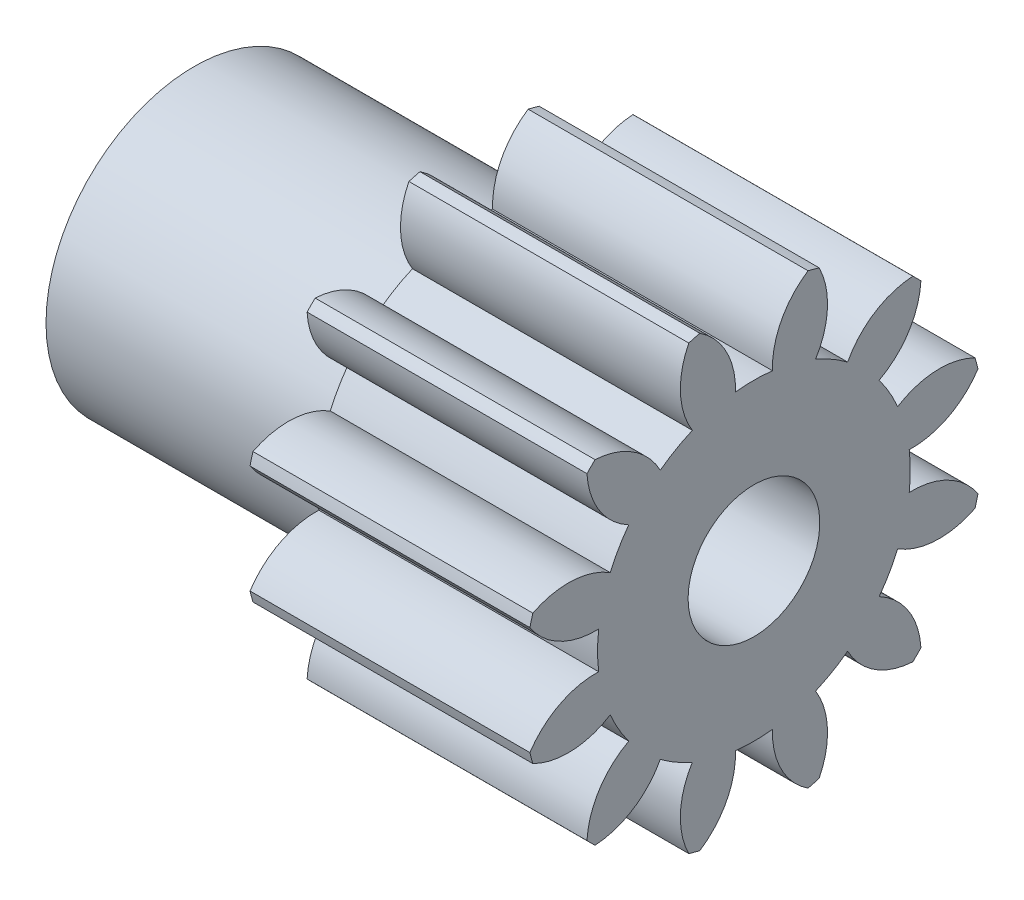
ISO-10303-21;
HEADER;
FILE_DESCRIPTION(('STEP AP214'),'2;1');
FILE_NAME('part.step','',(''),(''),'','','');
FILE_SCHEMA(('AUTOMOTIVE_DESIGN { 1 0 10303 214 1 1 1 1 }'));
ENDSEC;
DATA;
#1=APPLICATION_CONTEXT('core data for automotive mechanical design processes');
#2=APPLICATION_PROTOCOL_DEFINITION('international standard','automotive_design',2000,#1);
#3=PRODUCT_CONTEXT('',#1,'mechanical');
#4=PRODUCT('Part','Part','',(#3));
#5=PRODUCT_RELATED_PRODUCT_CATEGORY('part','',(#4));
#6=PRODUCT_DEFINITION_FORMATION('','',#4);
#7=PRODUCT_DEFINITION_CONTEXT('part definition',#1,'design');
#8=PRODUCT_DEFINITION('design','',#6,#7);
#9=PRODUCT_DEFINITION_SHAPE('','',#8);
#10=(LENGTH_UNIT() NAMED_UNIT(*) SI_UNIT(.MILLI.,.METRE.));
#11=(NAMED_UNIT(*) PLANE_ANGLE_UNIT() SI_UNIT($,.RADIAN.));
#12=(NAMED_UNIT(*) SI_UNIT($,.STERADIAN.) SOLID_ANGLE_UNIT());
#13=UNCERTAINTY_MEASURE_WITH_UNIT(LENGTH_MEASURE(1.E-05),#10,'distance_accuracy_value','');
#14=(GEOMETRIC_REPRESENTATION_CONTEXT(3) GLOBAL_UNCERTAINTY_ASSIGNED_CONTEXT((#13)) GLOBAL_UNIT_ASSIGNED_CONTEXT((#10,
#11,#12)) REPRESENTATION_CONTEXT('',''));
#15=CARTESIAN_POINT('',(0.,0.,0.));
#16=DIRECTION('',(0.,0.,1.));
#17=DIRECTION('',(1.,0.,0.));
#18=AXIS2_PLACEMENT_3D('',#15,#16,#17);
#19=CARTESIAN_POINT('',(8.5,0.,0.));
#20=DIRECTION('',(-1.,0.,0.));
#21=DIRECTION('',(0.,0.,1.));
#22=AXIS2_PLACEMENT_3D('',#19,#20,#21);
#23=PLANE('',#22);
#24=CARTESIAN_POINT('',(8.5,2.67495385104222,-4.96320681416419));
#25=DIRECTION('',(-1.,0.,0.));
#26=DIRECTION('',(0.,-0.499999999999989,-0.866025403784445));
#27=AXIS2_PLACEMENT_3D('',#24,#25,#26);
#28=CIRCLE('',#27,2.4);
#29=CARTESIAN_POINT('',(8.5,3.80272947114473,-2.84468795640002));
#30=VERTEX_POINT('',#29);
#31=CARTESIAN_POINT('',(8.5,5.07099717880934,-4.82545206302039));
#32=VERTEX_POINT('',#31);
#33=EDGE_CURVE('E350',#30,#32,#28,.T.);
#34=ORIENTED_EDGE('',*,*,#33,.F.);
#35=CARTESIAN_POINT('',(8.5,0.,0.));
#36=DIRECTION('',(-1.,0.,0.));
#37=DIRECTION('',(0.,-0.499999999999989,-0.866025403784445));
#38=AXIS2_PLACEMENT_3D('',#35,#36,#37);
#39=CIRCLE('',#38,4.749);
#40=CARTESIAN_POINT('',(8.5,4.36493677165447,-1.87091634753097));
#41=VERTEX_POINT('',#40);
#42=EDGE_CURVE('E643',#41,#30,#39,.T.);
#43=ORIENTED_EDGE('',*,*,#42,.F.);
#44=CARTESIAN_POINT('',(8.5,5.63574011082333,0.16502541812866));
#45=DIRECTION('',(-1.,0.,0.));
#46=DIRECTION('',(0.,-0.499999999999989,-0.866025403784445));
#47=AXIS2_PLACEMENT_3D('',#44,#45,#46);
#48=CIRCLE('',#47,2.4);
#49=CARTESIAN_POINT('',(8.5,6.71446266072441,-1.97888634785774));
#50=VERTEX_POINT('',#49);
#51=EDGE_CURVE('E340',#50,#41,#48,.T.);
#52=ORIENTED_EDGE('',*,*,#51,.F.);
#53=CARTESIAN_POINT('',(8.5,0.,0.));
#54=DIRECTION('',(-1.,0.,0.));
#55=DIRECTION('',(0.,0.,1.));
#56=AXIS2_PLACEMENT_3D('',#53,#54,#55);
#57=CIRCLE('',#56,7.);
#58=CARTESIAN_POINT('',(8.5,6.80433841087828,-1.64346548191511));
#59=VERTEX_POINT('',#58);
#60=EDGE_CURVE('E393',#59,#50,#57,.T.);
#61=ORIENTED_EDGE('',*,*,#60,.F.);
#62=CARTESIAN_POINT('',(8.5,4.79818139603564,-2.96078625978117));
#63=DIRECTION('',(-1.,0.,0.));
#64=DIRECTION('',(0.,0.,-1.));
#65=AXIS2_PLACEMENT_3D('',#62,#63,#64);
#66=CIRCLE('',#65,2.4);
#67=CARTESIAN_POINT('',(8.5,4.7156043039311,-0.562207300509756));
#68=VERTEX_POINT('',#67);
#69=EDGE_CURVE('E415',#68,#59,#66,.T.);
#70=ORIENTED_EDGE('',*,*,#69,.F.);
#71=CARTESIAN_POINT('',(8.5,0.,0.));
#72=DIRECTION('',(-1.,0.,0.));
#73=DIRECTION('',(0.,0.,-1.));
#74=AXIS2_PLACEMENT_3D('',#71,#72,#73);
#75=CIRCLE('',#74,4.749);
#76=CARTESIAN_POINT('',(8.5,4.7156043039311,0.562207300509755));
#77=VERTEX_POINT('',#76);
#78=EDGE_CURVE('E411',#77,#68,#75,.T.);
#79=ORIENTED_EDGE('',*,*,#78,.F.);
#80=CARTESIAN_POINT('',(8.5,4.79818139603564,2.96078625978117));
#81=DIRECTION('',(-1.,0.,0.));
#82=DIRECTION('',(0.,0.,-1.));
#83=AXIS2_PLACEMENT_3D('',#80,#81,#82);
#84=CIRCLE('',#83,2.4);
#85=CARTESIAN_POINT('',(8.5,6.80433841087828,1.6434654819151));
#86=VERTEX_POINT('',#85);
#87=EDGE_CURVE('E413',#86,#77,#84,.T.);
#88=ORIENTED_EDGE('',*,*,#87,.F.);
#89=CARTESIAN_POINT('',(8.5,6.71446266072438,1.97888634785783));
#90=VERTEX_POINT('',#89);
#91=EDGE_CURVE('E397',#90,#86,#57,.T.);
#92=ORIENTED_EDGE('',*,*,#91,.F.);
#93=CARTESIAN_POINT('',(8.5,5.63574011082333,-0.165025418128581));
#94=DIRECTION('',(-1.,0.,0.));
#95=DIRECTION('',(0.,0.500000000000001,-0.866025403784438));
#96=AXIS2_PLACEMENT_3D('',#93,#94,#95);
#97=CIRCLE('',#96,2.4);
#98=CARTESIAN_POINT('',(8.5,4.36493677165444,1.87091634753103));
#99=VERTEX_POINT('',#98);
#100=EDGE_CURVE('E436',#99,#90,#97,.T.);
#101=ORIENTED_EDGE('',*,*,#100,.F.);
#102=CARTESIAN_POINT('',(8.5,0.,0.));
#103=DIRECTION('',(-1.,0.,0.));
#104=DIRECTION('',(0.,0.500000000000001,-0.866025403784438));
#105=AXIS2_PLACEMENT_3D('',#102,#103,#104);
#106=CIRCLE('',#105,4.749);
#107=CARTESIAN_POINT('',(8.5,3.80272947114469,2.84468795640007));
#108=VERTEX_POINT('',#107);
#109=EDGE_CURVE('E432',#108,#99,#106,.T.);
#110=ORIENTED_EDGE('',*,*,#109,.F.);
#111=CARTESIAN_POINT('',(8.5,2.67495385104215,4.96320681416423));
#112=DIRECTION('',(-1.,0.,0.));
#113=DIRECTION('',(0.,0.500000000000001,-0.866025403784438));
#114=AXIS2_PLACEMENT_3D('',#111,#112,#113);
#115=CIRCLE('',#114,2.4);
#116=CARTESIAN_POINT('',(8.5,5.07099717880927,4.82545206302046));
#117=VERTEX_POINT('',#116);
#118=EDGE_CURVE('E434',#117,#108,#115,.T.);
#119=ORIENTED_EDGE('',*,*,#118,.F.);
#120=CARTESIAN_POINT('',(8.5,4.82545206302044,5.07099717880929));
#121=VERTEX_POINT('',#120);
#122=EDGE_CURVE('E727',#121,#117,#57,.T.);
#123=ORIENTED_EDGE('',*,*,#122,.F.);
#124=CARTESIAN_POINT('',(8.5,4.96320681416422,2.67495385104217));
#125=DIRECTION('',(-1.,0.,0.));
#126=DIRECTION('',(0.,0.86602540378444,-0.499999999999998));
#127=AXIS2_PLACEMENT_3D('',#124,#125,#126);
#128=CIRCLE('',#127,2.4);
#129=CARTESIAN_POINT('',(8.5,2.84468795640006,3.8027294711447));
#130=VERTEX_POINT('',#129);
#131=EDGE_CURVE('E458',#130,#121,#128,.T.);
#132=ORIENTED_EDGE('',*,*,#131,.F.);
#133=CARTESIAN_POINT('',(8.5,0.,0.));
#134=DIRECTION('',(-1.,0.,0.));
#135=DIRECTION('',(0.,0.86602540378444,-0.499999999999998));
#136=AXIS2_PLACEMENT_3D('',#133,#134,#135);
#137=CIRCLE('',#136,4.749);
#138=CARTESIAN_POINT('',(8.5,1.87091634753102,4.36493677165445));
#139=VERTEX_POINT('',#138);
#140=EDGE_CURVE('E454',#139,#130,#137,.T.);
#141=ORIENTED_EDGE('',*,*,#140,.F.);
#142=CARTESIAN_POINT('',(8.5,-0.165025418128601,5.63574011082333));
#143=DIRECTION('',(-1.,0.,0.));
#144=DIRECTION('',(0.,0.86602540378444,-0.499999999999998));
#145=AXIS2_PLACEMENT_3D('',#142,#143,#144);
#146=CIRCLE('',#145,2.4);
#147=CARTESIAN_POINT('',(8.5,1.97888634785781,6.71446266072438));
#148=VERTEX_POINT('',#147);
#149=EDGE_CURVE('E456',#148,#139,#146,.T.);
#150=ORIENTED_EDGE('',*,*,#149,.F.);
#151=CARTESIAN_POINT('',(8.5,1.64346548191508,6.80433841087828));
#152=VERTEX_POINT('',#151);
#153=EDGE_CURVE('E728',#152,#148,#57,.T.);
#154=ORIENTED_EDGE('',*,*,#153,.F.);
#155=CARTESIAN_POINT('',(8.5,2.96078625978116,4.79818139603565));
#156=DIRECTION('',(-1.,0.,0.));
#157=DIRECTION('',(0.,1.,0.));
#158=AXIS2_PLACEMENT_3D('',#155,#156,#157);
#159=CIRCLE('',#158,2.4);
#160=CARTESIAN_POINT('',(8.5,0.56220730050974,4.7156043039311));
#161=VERTEX_POINT('',#160);
#162=EDGE_CURVE('E480',#161,#152,#159,.T.);
#163=ORIENTED_EDGE('',*,*,#162,.F.);
#164=CARTESIAN_POINT('',(8.5,0.,0.));
#165=DIRECTION('',(-1.,0.,0.));
#166=DIRECTION('',(0.,1.,0.));
#167=AXIS2_PLACEMENT_3D('',#164,#165,#166);
#168=CIRCLE('',#167,4.749);
#169=CARTESIAN_POINT('',(8.5,-0.562207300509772,4.7156043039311));
#170=VERTEX_POINT('',#169);
#171=EDGE_CURVE('E476',#170,#161,#168,.T.);
#172=ORIENTED_EDGE('',*,*,#171,.F.);
#173=CARTESIAN_POINT('',(8.5,-2.96078625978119,4.79818139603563));
#174=DIRECTION('',(-1.,0.,0.));
#175=DIRECTION('',(0.,1.,0.));
#176=AXIS2_PLACEMENT_3D('',#173,#174,#175);
#177=CIRCLE('',#176,2.4);
#178=CARTESIAN_POINT('',(8.5,-1.64346548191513,6.80433841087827));
#179=VERTEX_POINT('',#178);
#180=EDGE_CURVE('E478',#179,#170,#177,.T.);
#181=ORIENTED_EDGE('',*,*,#180,.F.);
#182=CARTESIAN_POINT('',(8.5,-1.97888634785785,6.71446266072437));
#183=VERTEX_POINT('',#182);
#184=EDGE_CURVE('E733',#183,#179,#57,.T.);
#185=ORIENTED_EDGE('',*,*,#184,.F.);
#186=CARTESIAN_POINT('',(8.5,0.165025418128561,5.63574011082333));
#187=DIRECTION('',(-1.,0.,0.));
#188=DIRECTION('',(0.,0.866025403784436,0.500000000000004));
#189=AXIS2_PLACEMENT_3D('',#186,#187,#188);
#190=CIRCLE('',#189,2.4);
#191=CARTESIAN_POINT('',(8.5,-1.87091634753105,4.36493677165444));
#192=VERTEX_POINT('',#191);
#193=EDGE_CURVE('E502',#192,#183,#190,.T.);
#194=ORIENTED_EDGE('',*,*,#193,.F.);
#195=CARTESIAN_POINT('',(8.5,0.,0.));
#196=DIRECTION('',(-1.,0.,0.));
#197=DIRECTION('',(0.,0.866025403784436,0.500000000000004));
#198=AXIS2_PLACEMENT_3D('',#195,#196,#197);
#199=CIRCLE('',#198,4.749);
#200=CARTESIAN_POINT('',(8.5,-2.84468795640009,3.80272947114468));
#201=VERTEX_POINT('',#200);
#202=EDGE_CURVE('E498',#201,#192,#199,.T.);
#203=ORIENTED_EDGE('',*,*,#202,.F.);
#204=CARTESIAN_POINT('',(8.5,-4.96320681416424,2.67495385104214));
#205=DIRECTION('',(-1.,0.,0.));
#206=DIRECTION('',(0.,0.866025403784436,0.500000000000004));
#207=AXIS2_PLACEMENT_3D('',#204,#205,#206);
#208=CIRCLE('',#207,2.4);
#209=CARTESIAN_POINT('',(8.5,-4.82545206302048,5.07099717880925));
#210=VERTEX_POINT('',#209);
#211=EDGE_CURVE('E500',#210,#201,#208,.T.);
#212=ORIENTED_EDGE('',*,*,#211,.F.);
#213=CARTESIAN_POINT('',(8.5,-5.0709971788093,4.82545206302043));
#214=VERTEX_POINT('',#213);
#215=EDGE_CURVE('E738',#214,#210,#57,.T.);
#216=ORIENTED_EDGE('',*,*,#215,.F.);
#217=CARTESIAN_POINT('',(8.5,-2.67495385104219,4.96320681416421));
#218=DIRECTION('',(-1.,0.,0.));
#219=DIRECTION('',(0.,0.499999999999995,0.866025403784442));
#220=AXIS2_PLACEMENT_3D('',#217,#218,#219);
#221=CIRCLE('',#220,2.4);
#222=CARTESIAN_POINT('',(8.5,-3.80272947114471,2.84468795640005));
#223=VERTEX_POINT('',#222);
#224=EDGE_CURVE('E524',#223,#214,#221,.T.);
#225=ORIENTED_EDGE('',*,*,#224,.F.);
#226=CARTESIAN_POINT('',(8.5,0.,0.));
#227=DIRECTION('',(-1.,0.,0.));
#228=DIRECTION('',(0.,0.499999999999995,0.866025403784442));
#229=AXIS2_PLACEMENT_3D('',#226,#227,#228);
#230=CIRCLE('',#229,4.749);
#231=CARTESIAN_POINT('',(8.5,-4.36493677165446,1.870916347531));
#232=VERTEX_POINT('',#231);
#233=EDGE_CURVE('E520',#232,#223,#230,.T.);
#234=ORIENTED_EDGE('',*,*,#233,.F.);
#235=CARTESIAN_POINT('',(8.5,-5.63574011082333,-0.165025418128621));
#236=DIRECTION('',(-1.,0.,0.));
#237=DIRECTION('',(0.,0.499999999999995,0.866025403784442));
#238=AXIS2_PLACEMENT_3D('',#235,#236,#237);
#239=CIRCLE('',#238,2.4);
#240=CARTESIAN_POINT('',(8.5,-6.71446266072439,1.97888634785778));
#241=VERTEX_POINT('',#240);
#242=EDGE_CURVE('E522',#241,#232,#239,.T.);
#243=ORIENTED_EDGE('',*,*,#242,.F.);
#244=CARTESIAN_POINT('',(8.5,-6.80433841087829,1.64346548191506));
#245=VERTEX_POINT('',#244);
#246=EDGE_CURVE('E743',#245,#241,#57,.T.);
#247=ORIENTED_EDGE('',*,*,#246,.F.);
#248=CARTESIAN_POINT('',(8.5,-4.79818139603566,2.96078625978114));
#249=DIRECTION('',(-1.,0.,0.));
#250=DIRECTION('',(0.,0.,1.));
#251=AXIS2_PLACEMENT_3D('',#248,#249,#250);
#252=CIRCLE('',#251,2.4);
#253=CARTESIAN_POINT('',(8.5,-4.7156043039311,0.562207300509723));
#254=VERTEX_POINT('',#253);
#255=EDGE_CURVE('E546',#254,#245,#252,.T.);
#256=ORIENTED_EDGE('',*,*,#255,.F.);
#257=CARTESIAN_POINT('',(8.5,0.,0.));
#258=DIRECTION('',(-1.,0.,0.));
#259=DIRECTION('',(0.,0.,1.));
#260=AXIS2_PLACEMENT_3D('',#257,#258,#259);
#261=CIRCLE('',#260,4.749);
#262=CARTESIAN_POINT('',(8.5,-4.7156043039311,-0.562207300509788));
#263=VERTEX_POINT('',#262);
#264=EDGE_CURVE('E542',#263,#254,#261,.T.);
#265=ORIENTED_EDGE('',*,*,#264,.F.);
#266=CARTESIAN_POINT('',(8.5,-4.79818139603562,-2.96078625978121));
#267=DIRECTION('',(-1.,0.,0.));
#268=DIRECTION('',(0.,0.,1.));
#269=AXIS2_PLACEMENT_3D('',#266,#267,#268);
#270=CIRCLE('',#269,2.4);
#271=CARTESIAN_POINT('',(8.5,-6.80433841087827,-1.64346548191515));
#272=VERTEX_POINT('',#271);
#273=EDGE_CURVE('E544',#272,#263,#270,.T.);
#274=ORIENTED_EDGE('',*,*,#273,.F.);
#275=CARTESIAN_POINT('',(8.5,-6.71446266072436,-1.97888634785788));
#276=VERTEX_POINT('',#275);
#277=EDGE_CURVE('E748',#276,#272,#57,.T.);
#278=ORIENTED_EDGE('',*,*,#277,.F.);
#279=CARTESIAN_POINT('',(8.5,-5.63574011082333,0.165025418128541));
#280=DIRECTION('',(-1.,0.,0.));
#281=DIRECTION('',(0.,-0.500000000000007,0.866025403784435));
#282=AXIS2_PLACEMENT_3D('',#279,#280,#281);
#283=CIRCLE('',#282,2.4);
#284=CARTESIAN_POINT('',(8.5,-4.36493677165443,-1.87091634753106));
#285=VERTEX_POINT('',#284);
#286=EDGE_CURVE('E568',#285,#276,#283,.T.);
#287=ORIENTED_EDGE('',*,*,#286,.F.);
#288=CARTESIAN_POINT('',(8.5,0.,0.));
#289=DIRECTION('',(-1.,0.,0.));
#290=DIRECTION('',(0.,-0.500000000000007,0.866025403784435));
#291=AXIS2_PLACEMENT_3D('',#288,#289,#290);
#292=CIRCLE('',#291,4.749);
#293=CARTESIAN_POINT('',(8.5,-3.80272947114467,-2.8446879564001));
#294=VERTEX_POINT('',#293);
#295=EDGE_CURVE('E564',#294,#285,#292,.T.);
#296=ORIENTED_EDGE('',*,*,#295,.F.);
#297=CARTESIAN_POINT('',(8.5,-2.67495385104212,-4.96320681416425));
#298=DIRECTION('',(-1.,0.,0.));
#299=DIRECTION('',(0.,-0.500000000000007,0.866025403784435));
#300=AXIS2_PLACEMENT_3D('',#297,#298,#299);
#301=CIRCLE('',#300,2.4);
#302=CARTESIAN_POINT('',(8.5,-5.07099717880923,-4.8254520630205));
#303=VERTEX_POINT('',#302);
#304=EDGE_CURVE('E566',#303,#294,#301,.T.);
#305=ORIENTED_EDGE('',*,*,#304,.F.);
#306=CARTESIAN_POINT('',(8.5,-4.82545206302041,-5.07099717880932));
#307=VERTEX_POINT('',#306);
#308=EDGE_CURVE('E753',#307,#303,#57,.T.);
#309=ORIENTED_EDGE('',*,*,#308,.F.);
#310=CARTESIAN_POINT('',(8.5,-4.9632068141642,-2.67495385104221));
#311=DIRECTION('',(-1.,0.,0.));
#312=DIRECTION('',(0.,-0.866025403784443,0.499999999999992));
#313=AXIS2_PLACEMENT_3D('',#310,#311,#312);
#314=CIRCLE('',#313,2.4);
#315=CARTESIAN_POINT('',(8.5,-2.84468795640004,-3.80272947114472));
#316=VERTEX_POINT('',#315);
#317=EDGE_CURVE('E590',#316,#307,#314,.T.);
#318=ORIENTED_EDGE('',*,*,#317,.F.);
#319=CARTESIAN_POINT('',(8.5,0.,0.));
#320=DIRECTION('',(-1.,0.,0.));
#321=DIRECTION('',(0.,-0.866025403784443,0.499999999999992));
#322=AXIS2_PLACEMENT_3D('',#319,#320,#321);
#323=CIRCLE('',#322,4.749);
#324=CARTESIAN_POINT('',(8.5,-1.87091634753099,-4.36493677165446));
#325=VERTEX_POINT('',#324);
#326=EDGE_CURVE('E586',#325,#316,#323,.T.);
#327=ORIENTED_EDGE('',*,*,#326,.F.);
#328=CARTESIAN_POINT('',(8.5,0.16502541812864,-5.63574011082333));
#329=DIRECTION('',(-1.,0.,0.));
#330=DIRECTION('',(0.,-0.866025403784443,0.499999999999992));
#331=AXIS2_PLACEMENT_3D('',#328,#329,#330);
#332=CIRCLE('',#331,2.4);
#333=CARTESIAN_POINT('',(8.5,-1.97888634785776,-6.7144626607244));
#334=VERTEX_POINT('',#333);
#335=EDGE_CURVE('E588',#334,#325,#332,.T.);
#336=ORIENTED_EDGE('',*,*,#335,.F.);
#337=CARTESIAN_POINT('',(8.5,-1.64346548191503,-6.8043384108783));
#338=VERTEX_POINT('',#337);
#339=EDGE_CURVE('E758',#338,#334,#57,.T.);
#340=ORIENTED_EDGE('',*,*,#339,.F.);
#341=CARTESIAN_POINT('',(8.5,-2.96078625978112,-4.79818139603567));
#342=DIRECTION('',(-1.,0.,0.));
#343=DIRECTION('',(0.,-1.,0.));
#344=AXIS2_PLACEMENT_3D('',#341,#342,#343);
#345=CIRCLE('',#344,2.4);
#346=CARTESIAN_POINT('',(8.5,-0.562207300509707,-4.71560430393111));
#347=VERTEX_POINT('',#346);
#348=EDGE_CURVE('E612',#347,#338,#345,.T.);
#349=ORIENTED_EDGE('',*,*,#348,.F.);
#350=CARTESIAN_POINT('',(8.5,0.,0.));
#351=DIRECTION('',(-1.,0.,0.));
#352=DIRECTION('',(0.,-1.,0.));
#353=AXIS2_PLACEMENT_3D('',#350,#351,#352);
#354=CIRCLE('',#353,4.749);
#355=CARTESIAN_POINT('',(8.5,0.562207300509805,-4.71560430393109));
#356=VERTEX_POINT('',#355);
#357=EDGE_CURVE('E608',#356,#347,#354,.T.);
#358=ORIENTED_EDGE('',*,*,#357,.F.);
#359=CARTESIAN_POINT('',(8.5,2.96078625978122,-4.79818139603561));
#360=DIRECTION('',(-1.,0.,0.));
#361=DIRECTION('',(0.,-1.,0.));
#362=AXIS2_PLACEMENT_3D('',#359,#360,#361);
#363=CIRCLE('',#362,2.4);
#364=CARTESIAN_POINT('',(8.5,1.64346548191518,-6.80433841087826));
#365=VERTEX_POINT('',#364);
#366=EDGE_CURVE('E610',#365,#356,#363,.T.);
#367=ORIENTED_EDGE('',*,*,#366,.F.);
#368=CARTESIAN_POINT('',(8.5,1.9788863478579,-6.71446266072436));
#369=VERTEX_POINT('',#368);
#370=EDGE_CURVE('E763',#369,#365,#57,.T.);
#371=ORIENTED_EDGE('',*,*,#370,.F.);
#372=CARTESIAN_POINT('',(8.5,-0.165025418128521,-5.63574011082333));
#373=DIRECTION('',(-1.,0.,0.));
#374=DIRECTION('',(0.,-0.866025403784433,-0.50000000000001));
#375=AXIS2_PLACEMENT_3D('',#372,#373,#374);
#376=CIRCLE('',#375,2.4);
#377=CARTESIAN_POINT('',(8.5,1.87091634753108,-4.36493677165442));
#378=VERTEX_POINT('',#377);
#379=EDGE_CURVE('E633',#378,#369,#376,.T.);
#380=ORIENTED_EDGE('',*,*,#379,.F.);
#381=CARTESIAN_POINT('',(8.5,0.,0.));
#382=DIRECTION('',(-1.,0.,0.));
#383=DIRECTION('',(0.,-0.866025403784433,-0.50000000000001));
#384=AXIS2_PLACEMENT_3D('',#381,#382,#383);
#385=CIRCLE('',#384,4.749);
#386=CARTESIAN_POINT('',(8.5,2.84468795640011,-3.80272947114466));
#387=VERTEX_POINT('',#386);
#388=EDGE_CURVE('E629',#387,#378,#385,.T.);
#389=ORIENTED_EDGE('',*,*,#388,.F.);
#390=CARTESIAN_POINT('',(8.5,4.96320681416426,-2.6749538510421));
#391=DIRECTION('',(-1.,0.,0.));
#392=DIRECTION('',(0.,-0.866025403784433,-0.50000000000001));
#393=AXIS2_PLACEMENT_3D('',#390,#391,#392);
#394=CIRCLE('',#393,2.4);
#395=CARTESIAN_POINT('',(8.5,4.82545206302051,-5.07099717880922));
#396=VERTEX_POINT('',#395);
#397=EDGE_CURVE('E631',#396,#387,#394,.T.);
#398=ORIENTED_EDGE('',*,*,#397,.F.);
#399=EDGE_CURVE('E396',#32,#396,#57,.T.);
#400=ORIENTED_EDGE('',*,*,#399,.F.);
#401=EDGE_LOOP('',(#34,#43,#52,#61,#70,#79,#88,#92,#101,#110,#119,#123,#132,#141,#150,#154,#163,
#172,#181,#185,#194,#203,#212,#216,#225,#234,#243,#247,#256,#265,#274,#278,#287,#296,#305,#309,
#318,#327,#336,#340,#349,#358,#367,#371,#380,#389,#398,#400));
#402=FACE_BOUND('',#401,.T.);
#403=CARTESIAN_POINT('',(8.5,0.,0.));
#404=DIRECTION('',(-1.,0.,0.));
#405=DIRECTION('',(0.,0.,1.));
#406=AXIS2_PLACEMENT_3D('',#403,#404,#405);
#407=CIRCLE('',#406,2.);
#408=CARTESIAN_POINT('',(8.5,0.,2.));
#409=VERTEX_POINT('',#408);
#410=EDGE_CURVE('E651',#409,#409,#407,.F.);
#411=ORIENTED_EDGE('',*,*,#410,.F.);
#412=EDGE_LOOP('',(#411));
#413=FACE_BOUND('',#412,.T.);
#414=ADVANCED_FACE('F28',(#402,#413),#23,.F.);
#415=CARTESIAN_POINT('',(-8.5000508,0.,0.));
#416=DIRECTION('',(-1.,0.,0.));
#417=DIRECTION('',(0.,0.,1.));
#418=AXIS2_PLACEMENT_3D('',#415,#416,#417);
#419=PLANE('',#418);
#420=CARTESIAN_POINT('',(-8.5000508,0.,0.));
#421=DIRECTION('',(-1.,0.,0.));
#422=DIRECTION('',(0.,0.,1.));
#423=AXIS2_PLACEMENT_3D('',#420,#421,#422);
#424=CIRCLE('',#423,4.5);
#425=CARTESIAN_POINT('',(-8.5000508,0.,4.5));
#426=VERTEX_POINT('',#425);
#427=EDGE_CURVE('E648',#426,#426,#424,.T.);
#428=ORIENTED_EDGE('',*,*,#427,.T.);
#429=EDGE_LOOP('',(#428));
#430=FACE_BOUND('',#429,.T.);
#431=CARTESIAN_POINT('',(-8.5000508,0.,0.));
#432=DIRECTION('',(-1.,0.,0.));
#433=DIRECTION('',(0.,0.,1.));
#434=AXIS2_PLACEMENT_3D('',#431,#432,#433);
#435=CIRCLE('',#434,2.);
#436=CARTESIAN_POINT('',(-8.5000508,0.,2.));
#437=VERTEX_POINT('',#436);
#438=EDGE_CURVE('E31',#437,#437,#435,.F.);
#439=ORIENTED_EDGE('',*,*,#438,.T.);
#440=EDGE_LOOP('',(#439));
#441=FACE_BOUND('',#440,.T.);
#442=ADVANCED_FACE('F658',(#430,#441),#419,.T.);
#443=CARTESIAN_POINT('',(0.,0.,0.));
#444=DIRECTION('',(1.,0.,0.));
#445=DIRECTION('',(0.,0.,-1.));
#446=AXIS2_PLACEMENT_3D('',#443,#444,#445);
#447=PLANE('',#446);
#448=CARTESIAN_POINT('',(0.,2.67495385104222,-4.96320681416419));
#449=DIRECTION('',(-1.,0.,0.));
#450=DIRECTION('',(0.,-0.499999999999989,-0.866025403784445));
#451=AXIS2_PLACEMENT_3D('',#448,#449,#450);
#452=CIRCLE('',#451,2.4);
#453=CARTESIAN_POINT('',(0.,3.80272947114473,-2.84468795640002));
#454=VERTEX_POINT('',#453);
#455=CARTESIAN_POINT('',(0.,5.07099717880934,-4.82545206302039));
#456=VERTEX_POINT('',#455);
#457=EDGE_CURVE('E43',#454,#456,#452,.T.);
#458=ORIENTED_EDGE('',*,*,#457,.T.);
#459=CARTESIAN_POINT('',(0.,0.,0.));
#460=DIRECTION('',(-1.,0.,0.));
#461=DIRECTION('',(0.,0.,1.));
#462=AXIS2_PLACEMENT_3D('',#459,#460,#461);
#463=CIRCLE('',#462,7.);
#464=CARTESIAN_POINT('',(0.,4.82545206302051,-5.07099717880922));
#465=VERTEX_POINT('',#464);
#466=EDGE_CURVE('E399',#456,#465,#463,.T.);
#467=ORIENTED_EDGE('',*,*,#466,.T.);
#468=CARTESIAN_POINT('',(0.,4.96320681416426,-2.6749538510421));
#469=DIRECTION('',(1.,0.,0.));
#470=DIRECTION('',(0.,0.,-1.));
#471=AXIS2_PLACEMENT_3D('',#468,#469,#470);
#472=CIRCLE('',#471,2.4);
#473=CARTESIAN_POINT('',(0.,2.84468795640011,-3.80272947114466));
#474=VERTEX_POINT('',#473);
#475=EDGE_CURVE('E358',#474,#465,#472,.T.);
#476=ORIENTED_EDGE('',*,*,#475,.F.);
#477=CARTESIAN_POINT('',(0.,0.,0.));
#478=DIRECTION('',(-1.,0.,0.));
#479=DIRECTION('',(0.,-0.866025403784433,-0.50000000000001));
#480=AXIS2_PLACEMENT_3D('',#477,#478,#479);
#481=CIRCLE('',#480,4.749);
#482=CARTESIAN_POINT('',(0.,1.87091634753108,-4.36493677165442));
#483=VERTEX_POINT('',#482);
#484=EDGE_CURVE('E635',#474,#483,#481,.T.);
#485=ORIENTED_EDGE('',*,*,#484,.T.);
#486=CARTESIAN_POINT('',(0.,-0.165025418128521,-5.63574011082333));
#487=DIRECTION('',(-1.,0.,0.));
#488=DIRECTION('',(0.,-0.866025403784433,-0.50000000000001));
#489=AXIS2_PLACEMENT_3D('',#486,#487,#488);
#490=CIRCLE('',#489,2.4);
#491=CARTESIAN_POINT('',(0.,1.9788863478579,-6.71446266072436));
#492=VERTEX_POINT('',#491);
#493=EDGE_CURVE('E51',#483,#492,#490,.T.);
#494=ORIENTED_EDGE('',*,*,#493,.T.);
#495=CARTESIAN_POINT('',(0.,1.64346548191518,-6.80433841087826));
#496=VERTEX_POINT('',#495);
#497=EDGE_CURVE('E687',#492,#496,#463,.T.);
#498=ORIENTED_EDGE('',*,*,#497,.T.);
#499=CARTESIAN_POINT('',(0.,2.96078625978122,-4.79818139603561));
#500=DIRECTION('',(1.,0.,0.));
#501=DIRECTION('',(0.,0.,-1.));
#502=AXIS2_PLACEMENT_3D('',#499,#500,#501);
#503=CIRCLE('',#502,2.4);
#504=CARTESIAN_POINT('',(0.,0.562207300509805,-4.71560430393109));
#505=VERTEX_POINT('',#504);
#506=EDGE_CURVE('E361',#505,#496,#503,.T.);
#507=ORIENTED_EDGE('',*,*,#506,.F.);
#508=CARTESIAN_POINT('',(0.,0.,0.));
#509=DIRECTION('',(-1.,0.,0.));
#510=DIRECTION('',(0.,-1.,0.));
#511=AXIS2_PLACEMENT_3D('',#508,#509,#510);
#512=CIRCLE('',#511,4.749);
#513=CARTESIAN_POINT('',(0.,-0.562207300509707,-4.71560430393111));
#514=VERTEX_POINT('',#513);
#515=EDGE_CURVE('E614',#505,#514,#512,.T.);
#516=ORIENTED_EDGE('',*,*,#515,.T.);
#517=CARTESIAN_POINT('',(0.,-2.96078625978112,-4.79818139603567));
#518=DIRECTION('',(-1.,0.,0.));
#519=DIRECTION('',(0.,-1.,0.));
#520=AXIS2_PLACEMENT_3D('',#517,#518,#519);
#521=CIRCLE('',#520,2.4);
#522=CARTESIAN_POINT('',(0.,-1.64346548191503,-6.8043384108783));
#523=VERTEX_POINT('',#522);
#524=EDGE_CURVE('E617',#514,#523,#521,.T.);
#525=ORIENTED_EDGE('',*,*,#524,.T.);
#526=CARTESIAN_POINT('',(0.,-1.97888634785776,-6.7144626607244));
#527=VERTEX_POINT('',#526);
#528=EDGE_CURVE('E688',#523,#527,#463,.T.);
#529=ORIENTED_EDGE('',*,*,#528,.T.);
#530=CARTESIAN_POINT('',(0.,0.16502541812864,-5.63574011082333));
#531=DIRECTION('',(1.,0.,0.));
#532=DIRECTION('',(0.,0.,-1.));
#533=AXIS2_PLACEMENT_3D('',#530,#531,#532);
#534=CIRCLE('',#533,2.4);
#535=CARTESIAN_POINT('',(0.,-1.87091634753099,-4.36493677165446));
#536=VERTEX_POINT('',#535);
#537=EDGE_CURVE('E366',#536,#527,#534,.T.);
#538=ORIENTED_EDGE('',*,*,#537,.F.);
#539=CARTESIAN_POINT('',(0.,0.,0.));
#540=DIRECTION('',(-1.,0.,0.));
#541=DIRECTION('',(0.,-0.866025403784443,0.499999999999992));
#542=AXIS2_PLACEMENT_3D('',#539,#540,#541);
#543=CIRCLE('',#542,4.749);
#544=CARTESIAN_POINT('',(0.,-2.84468795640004,-3.80272947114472));
#545=VERTEX_POINT('',#544);
#546=EDGE_CURVE('E592',#536,#545,#543,.T.);
#547=ORIENTED_EDGE('',*,*,#546,.T.);
#548=CARTESIAN_POINT('',(0.,-4.9632068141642,-2.67495385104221));
#549=DIRECTION('',(-1.,0.,0.));
#550=DIRECTION('',(0.,-0.866025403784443,0.499999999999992));
#551=AXIS2_PLACEMENT_3D('',#548,#549,#550);
#552=CIRCLE('',#551,2.4);
#553=CARTESIAN_POINT('',(0.,-4.82545206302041,-5.07099717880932));
#554=VERTEX_POINT('',#553);
#555=EDGE_CURVE('E595',#545,#554,#552,.T.);
#556=ORIENTED_EDGE('',*,*,#555,.T.);
#557=CARTESIAN_POINT('',(0.,-5.07099717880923,-4.8254520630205));
#558=VERTEX_POINT('',#557);
#559=EDGE_CURVE('E691',#554,#558,#463,.T.);
#560=ORIENTED_EDGE('',*,*,#559,.T.);
#561=CARTESIAN_POINT('',(0.,-2.67495385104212,-4.96320681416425));
#562=DIRECTION('',(1.,0.,0.));
#563=DIRECTION('',(0.,0.,-1.));
#564=AXIS2_PLACEMENT_3D('',#561,#562,#563);
#565=CIRCLE('',#564,2.4);
#566=CARTESIAN_POINT('',(0.,-3.80272947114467,-2.8446879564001));
#567=VERTEX_POINT('',#566);
#568=EDGE_CURVE('E369',#567,#558,#565,.T.);
#569=ORIENTED_EDGE('',*,*,#568,.F.);
#570=CARTESIAN_POINT('',(0.,0.,0.));
#571=DIRECTION('',(-1.,0.,0.));
#572=DIRECTION('',(0.,-0.500000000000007,0.866025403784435));
#573=AXIS2_PLACEMENT_3D('',#570,#571,#572);
#574=CIRCLE('',#573,4.749);
#575=CARTESIAN_POINT('',(0.,-4.36493677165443,-1.87091634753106));
#576=VERTEX_POINT('',#575);
#577=EDGE_CURVE('E570',#567,#576,#574,.T.);
#578=ORIENTED_EDGE('',*,*,#577,.T.);
#579=CARTESIAN_POINT('',(0.,-5.63574011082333,0.165025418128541));
#580=DIRECTION('',(-1.,0.,0.));
#581=DIRECTION('',(0.,-0.500000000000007,0.866025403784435));
#582=AXIS2_PLACEMENT_3D('',#579,#580,#581);
#583=CIRCLE('',#582,2.4);
#584=CARTESIAN_POINT('',(0.,-6.71446266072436,-1.97888634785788));
#585=VERTEX_POINT('',#584);
#586=EDGE_CURVE('E573',#576,#585,#583,.T.);
#587=ORIENTED_EDGE('',*,*,#586,.T.);
#588=CARTESIAN_POINT('',(0.,-6.80433841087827,-1.64346548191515));
#589=VERTEX_POINT('',#588);
#590=EDGE_CURVE('E694',#585,#589,#463,.T.);
#591=ORIENTED_EDGE('',*,*,#590,.T.);
#592=CARTESIAN_POINT('',(0.,-4.79818139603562,-2.96078625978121));
#593=DIRECTION('',(1.,0.,0.));
#594=DIRECTION('',(0.,0.,-1.));
#595=AXIS2_PLACEMENT_3D('',#592,#593,#594);
#596=CIRCLE('',#595,2.4);
#597=CARTESIAN_POINT('',(0.,-4.7156043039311,-0.562207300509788));
#598=VERTEX_POINT('',#597);
#599=EDGE_CURVE('E372',#598,#589,#596,.T.);
#600=ORIENTED_EDGE('',*,*,#599,.F.);
#601=CARTESIAN_POINT('',(0.,0.,0.));
#602=DIRECTION('',(-1.,0.,0.));
#603=DIRECTION('',(0.,0.,1.));
#604=AXIS2_PLACEMENT_3D('',#601,#602,#603);
#605=CIRCLE('',#604,4.749);
#606=CARTESIAN_POINT('',(0.,-4.7156043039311,0.562207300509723));
#607=VERTEX_POINT('',#606);
#608=EDGE_CURVE('E548',#598,#607,#605,.T.);
#609=ORIENTED_EDGE('',*,*,#608,.T.);
#610=CARTESIAN_POINT('',(0.,-4.79818139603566,2.96078625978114));
#611=DIRECTION('',(-1.,0.,0.));
#612=DIRECTION('',(0.,0.,1.));
#613=AXIS2_PLACEMENT_3D('',#610,#611,#612);
#614=CIRCLE('',#613,2.4);
#615=CARTESIAN_POINT('',(0.,-6.80433841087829,1.64346548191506));
#616=VERTEX_POINT('',#615);
#617=EDGE_CURVE('E551',#607,#616,#614,.T.);
#618=ORIENTED_EDGE('',*,*,#617,.T.);
#619=CARTESIAN_POINT('',(0.,-6.71446266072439,1.97888634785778));
#620=VERTEX_POINT('',#619);
#621=EDGE_CURVE('E697',#616,#620,#463,.T.);
#622=ORIENTED_EDGE('',*,*,#621,.T.);
#623=CARTESIAN_POINT('',(0.,-5.63574011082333,-0.165025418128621));
#624=DIRECTION('',(1.,0.,0.));
#625=DIRECTION('',(0.,0.,-1.));
#626=AXIS2_PLACEMENT_3D('',#623,#624,#625);
#627=CIRCLE('',#626,2.4);
#628=CARTESIAN_POINT('',(0.,-4.36493677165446,1.870916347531));
#629=VERTEX_POINT('',#628);
#630=EDGE_CURVE('E375',#629,#620,#627,.T.);
#631=ORIENTED_EDGE('',*,*,#630,.F.);
#632=CARTESIAN_POINT('',(0.,0.,0.));
#633=DIRECTION('',(-1.,0.,0.));
#634=DIRECTION('',(0.,0.499999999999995,0.866025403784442));
#635=AXIS2_PLACEMENT_3D('',#632,#633,#634);
#636=CIRCLE('',#635,4.749);
#637=CARTESIAN_POINT('',(0.,-3.80272947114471,2.84468795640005));
#638=VERTEX_POINT('',#637);
#639=EDGE_CURVE('E526',#629,#638,#636,.T.);
#640=ORIENTED_EDGE('',*,*,#639,.T.);
#641=CARTESIAN_POINT('',(0.,-2.67495385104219,4.96320681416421));
#642=DIRECTION('',(-1.,0.,0.));
#643=DIRECTION('',(0.,0.499999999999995,0.866025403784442));
#644=AXIS2_PLACEMENT_3D('',#641,#642,#643);
#645=CIRCLE('',#644,2.4);
#646=CARTESIAN_POINT('',(0.,-5.0709971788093,4.82545206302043));
#647=VERTEX_POINT('',#646);
#648=EDGE_CURVE('E529',#638,#647,#645,.T.);
#649=ORIENTED_EDGE('',*,*,#648,.T.);
#650=CARTESIAN_POINT('',(0.,-4.82545206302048,5.07099717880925));
#651=VERTEX_POINT('',#650);
#652=EDGE_CURVE('E700',#647,#651,#463,.T.);
#653=ORIENTED_EDGE('',*,*,#652,.T.);
#654=CARTESIAN_POINT('',(0.,-4.96320681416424,2.67495385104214));
#655=DIRECTION('',(1.,0.,0.));
#656=DIRECTION('',(0.,0.,-1.));
#657=AXIS2_PLACEMENT_3D('',#654,#655,#656);
#658=CIRCLE('',#657,2.4);
#659=CARTESIAN_POINT('',(0.,-2.84468795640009,3.80272947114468));
#660=VERTEX_POINT('',#659);
#661=EDGE_CURVE('E378',#660,#651,#658,.T.);
#662=ORIENTED_EDGE('',*,*,#661,.F.);
#663=CARTESIAN_POINT('',(0.,0.,0.));
#664=DIRECTION('',(-1.,0.,0.));
#665=DIRECTION('',(0.,0.866025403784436,0.500000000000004));
#666=AXIS2_PLACEMENT_3D('',#663,#664,#665);
#667=CIRCLE('',#666,4.749);
#668=CARTESIAN_POINT('',(0.,-1.87091634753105,4.36493677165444));
#669=VERTEX_POINT('',#668);
#670=EDGE_CURVE('E504',#660,#669,#667,.T.);
#671=ORIENTED_EDGE('',*,*,#670,.T.);
#672=CARTESIAN_POINT('',(0.,0.165025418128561,5.63574011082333));
#673=DIRECTION('',(-1.,0.,0.));
#674=DIRECTION('',(0.,0.866025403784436,0.500000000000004));
#675=AXIS2_PLACEMENT_3D('',#672,#673,#674);
#676=CIRCLE('',#675,2.4);
#677=CARTESIAN_POINT('',(0.,-1.97888634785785,6.71446266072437));
#678=VERTEX_POINT('',#677);
#679=EDGE_CURVE('E507',#669,#678,#676,.T.);
#680=ORIENTED_EDGE('',*,*,#679,.T.);
#681=CARTESIAN_POINT('',(0.,-1.64346548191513,6.80433841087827));
#682=VERTEX_POINT('',#681);
#683=EDGE_CURVE('E703',#678,#682,#463,.T.);
#684=ORIENTED_EDGE('',*,*,#683,.T.);
#685=CARTESIAN_POINT('',(0.,-2.96078625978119,4.79818139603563));
#686=DIRECTION('',(1.,0.,0.));
#687=DIRECTION('',(0.,0.,-1.));
#688=AXIS2_PLACEMENT_3D('',#685,#686,#687);
#689=CIRCLE('',#688,2.4);
#690=CARTESIAN_POINT('',(0.,-0.562207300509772,4.7156043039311));
#691=VERTEX_POINT('',#690);
#692=EDGE_CURVE('E381',#691,#682,#689,.T.);
#693=ORIENTED_EDGE('',*,*,#692,.F.);
#694=CARTESIAN_POINT('',(0.,0.,0.));
#695=DIRECTION('',(-1.,0.,0.));
#696=DIRECTION('',(0.,1.,0.));
#697=AXIS2_PLACEMENT_3D('',#694,#695,#696);
#698=CIRCLE('',#697,4.749);
#699=CARTESIAN_POINT('',(0.,0.56220730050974,4.7156043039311));
#700=VERTEX_POINT('',#699);
#701=EDGE_CURVE('E482',#691,#700,#698,.T.);
#702=ORIENTED_EDGE('',*,*,#701,.T.);
#703=CARTESIAN_POINT('',(0.,2.96078625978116,4.79818139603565));
#704=DIRECTION('',(-1.,0.,0.));
#705=DIRECTION('',(0.,1.,0.));
#706=AXIS2_PLACEMENT_3D('',#703,#704,#705);
#707=CIRCLE('',#706,2.4);
#708=CARTESIAN_POINT('',(0.,1.64346548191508,6.80433841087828));
#709=VERTEX_POINT('',#708);
#710=EDGE_CURVE('E485',#700,#709,#707,.T.);
#711=ORIENTED_EDGE('',*,*,#710,.T.);
#712=CARTESIAN_POINT('',(0.,1.97888634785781,6.71446266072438));
#713=VERTEX_POINT('',#712);
#714=EDGE_CURVE('E706',#709,#713,#463,.T.);
#715=ORIENTED_EDGE('',*,*,#714,.T.);
#716=CARTESIAN_POINT('',(0.,-0.165025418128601,5.63574011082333));
#717=DIRECTION('',(1.,0.,0.));
#718=DIRECTION('',(0.,0.,-1.));
#719=AXIS2_PLACEMENT_3D('',#716,#717,#718);
#720=CIRCLE('',#719,2.4);
#721=CARTESIAN_POINT('',(0.,1.87091634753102,4.36493677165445));
#722=VERTEX_POINT('',#721);
#723=EDGE_CURVE('E384',#722,#713,#720,.T.);
#724=ORIENTED_EDGE('',*,*,#723,.F.);
#725=CARTESIAN_POINT('',(0.,0.,0.));
#726=DIRECTION('',(-1.,0.,0.));
#727=DIRECTION('',(0.,0.86602540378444,-0.499999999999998));
#728=AXIS2_PLACEMENT_3D('',#725,#726,#727);
#729=CIRCLE('',#728,4.749);
#730=CARTESIAN_POINT('',(0.,2.84468795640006,3.8027294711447));
#731=VERTEX_POINT('',#730);
#732=EDGE_CURVE('E460',#722,#731,#729,.T.);
#733=ORIENTED_EDGE('',*,*,#732,.T.);
#734=CARTESIAN_POINT('',(0.,4.96320681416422,2.67495385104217));
#735=DIRECTION('',(-1.,0.,0.));
#736=DIRECTION('',(0.,0.86602540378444,-0.499999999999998));
#737=AXIS2_PLACEMENT_3D('',#734,#735,#736);
#738=CIRCLE('',#737,2.4);
#739=CARTESIAN_POINT('',(0.,4.82545206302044,5.07099717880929));
#740=VERTEX_POINT('',#739);
#741=EDGE_CURVE('E463',#731,#740,#738,.T.);
#742=ORIENTED_EDGE('',*,*,#741,.T.);
#743=CARTESIAN_POINT('',(0.,5.07099717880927,4.82545206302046));
#744=VERTEX_POINT('',#743);
#745=EDGE_CURVE('E709',#740,#744,#463,.T.);
#746=ORIENTED_EDGE('',*,*,#745,.T.);
#747=CARTESIAN_POINT('',(0.,2.67495385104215,4.96320681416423));
#748=DIRECTION('',(1.,0.,0.));
#749=DIRECTION('',(0.,0.,-1.));
#750=AXIS2_PLACEMENT_3D('',#747,#748,#749);
#751=CIRCLE('',#750,2.4);
#752=CARTESIAN_POINT('',(0.,3.80272947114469,2.84468795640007));
#753=VERTEX_POINT('',#752);
#754=EDGE_CURVE('E387',#753,#744,#751,.T.);
#755=ORIENTED_EDGE('',*,*,#754,.F.);
#756=CARTESIAN_POINT('',(0.,0.,0.));
#757=DIRECTION('',(-1.,0.,0.));
#758=DIRECTION('',(0.,0.500000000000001,-0.866025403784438));
#759=AXIS2_PLACEMENT_3D('',#756,#757,#758);
#760=CIRCLE('',#759,4.749);
#761=CARTESIAN_POINT('',(0.,4.36493677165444,1.87091634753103));
#762=VERTEX_POINT('',#761);
#763=EDGE_CURVE('E438',#753,#762,#760,.T.);
#764=ORIENTED_EDGE('',*,*,#763,.T.);
#765=CARTESIAN_POINT('',(0.,5.63574011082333,-0.165025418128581));
#766=DIRECTION('',(-1.,0.,0.));
#767=DIRECTION('',(0.,0.500000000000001,-0.866025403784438));
#768=AXIS2_PLACEMENT_3D('',#765,#766,#767);
#769=CIRCLE('',#768,2.4);
#770=CARTESIAN_POINT('',(0.,6.71446266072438,1.97888634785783));
#771=VERTEX_POINT('',#770);
#772=EDGE_CURVE('E441',#762,#771,#769,.T.);
#773=ORIENTED_EDGE('',*,*,#772,.T.);
#774=CARTESIAN_POINT('',(0.,6.80433841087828,1.6434654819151));
#775=VERTEX_POINT('',#774);
#776=EDGE_CURVE('E400',#771,#775,#463,.T.);
#777=ORIENTED_EDGE('',*,*,#776,.T.);
#778=CARTESIAN_POINT('',(0.,4.79818139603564,2.96078625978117));
#779=DIRECTION('',(1.,0.,0.));
#780=DIRECTION('',(0.,0.,-1.));
#781=AXIS2_PLACEMENT_3D('',#778,#779,#780);
#782=CIRCLE('',#781,2.4);
#783=CARTESIAN_POINT('',(0.,4.7156043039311,0.562207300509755));
#784=VERTEX_POINT('',#783);
#785=EDGE_CURVE('E390',#784,#775,#782,.T.);
#786=ORIENTED_EDGE('',*,*,#785,.F.);
#787=CARTESIAN_POINT('',(0.,0.,0.));
#788=DIRECTION('',(-1.,0.,0.));
#789=DIRECTION('',(0.,0.,-1.));
#790=AXIS2_PLACEMENT_3D('',#787,#788,#789);
#791=CIRCLE('',#790,4.749);
#792=CARTESIAN_POINT('',(0.,4.7156043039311,-0.562207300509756));
#793=VERTEX_POINT('',#792);
#794=EDGE_CURVE('E417',#784,#793,#791,.T.);
#795=ORIENTED_EDGE('',*,*,#794,.T.);
#796=CARTESIAN_POINT('',(0.,4.79818139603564,-2.96078625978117));
#797=DIRECTION('',(-1.,0.,0.));
#798=DIRECTION('',(0.,0.,-1.));
#799=AXIS2_PLACEMENT_3D('',#796,#797,#798);
#800=CIRCLE('',#799,2.4);
#801=CARTESIAN_POINT('',(0.,6.80433841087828,-1.6434654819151));
#802=VERTEX_POINT('',#801);
#803=EDGE_CURVE('E420',#793,#802,#800,.T.);
#804=ORIENTED_EDGE('',*,*,#803,.T.);
#805=CARTESIAN_POINT('',(0.,6.7144626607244,-1.97888634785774));
#806=VERTEX_POINT('',#805);
#807=EDGE_CURVE('E357',#802,#806,#463,.T.);
#808=ORIENTED_EDGE('',*,*,#807,.T.);
#809=CARTESIAN_POINT('',(0.,5.63574011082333,0.16502541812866));
#810=DIRECTION('',(1.,0.,0.));
#811=DIRECTION('',(0.,0.,-1.));
#812=AXIS2_PLACEMENT_3D('',#809,#810,#811);
#813=CIRCLE('',#812,2.4);
#814=CARTESIAN_POINT('',(0.,4.36493677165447,-1.87091634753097));
#815=VERTEX_POINT('',#814);
#816=EDGE_CURVE('E36',#815,#806,#813,.T.);
#817=ORIENTED_EDGE('',*,*,#816,.F.);
#818=CARTESIAN_POINT('',(0.,0.,0.));
#819=DIRECTION('',(-1.,0.,0.));
#820=DIRECTION('',(0.,-0.499999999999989,-0.866025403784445));
#821=AXIS2_PLACEMENT_3D('',#818,#819,#820);
#822=CIRCLE('',#821,4.749);
#823=EDGE_CURVE('E347',#815,#454,#822,.T.);
#824=ORIENTED_EDGE('',*,*,#823,.T.);
#825=EDGE_LOOP('',(#458,#467,#476,#485,#494,#498,#507,#516,#525,#529,#538,#547,#556,#560,#569,
#578,#587,#591,#600,#609,#618,#622,#631,#640,#649,#653,#662,#671,#680,#684,#693,#702,#711,#715,
#724,#733,#742,#746,#755,#764,#773,#777,#786,#795,#804,#808,#817,#824));
#826=FACE_BOUND('',#825,.T.);
#827=CARTESIAN_POINT('',(0.,0.,0.));
#828=DIRECTION('',(1.,0.,0.));
#829=DIRECTION('',(0.,0.,-1.));
#830=AXIS2_PLACEMENT_3D('',#827,#828,#829);
#831=CIRCLE('',#830,4.5);
#832=CARTESIAN_POINT('',(0.,0.,-4.5));
#833=VERTEX_POINT('',#832);
#834=EDGE_CURVE('E11',#833,#833,#831,.F.);
#835=ORIENTED_EDGE('',*,*,#834,.F.);
#836=EDGE_LOOP('',(#835));
#837=FACE_BOUND('',#836,.T.);
#838=ADVANCED_FACE('F353',(#826,#837),#447,.F.);
#839=CARTESIAN_POINT('',(-10.,0.,0.));
#840=DIRECTION('',(-1.,0.,0.));
#841=DIRECTION('',(0.,0.,1.));
#842=AXIS2_PLACEMENT_3D('',#839,#840,#841);
#843=CYLINDRICAL_SURFACE('',#842,7.);
#844=DIRECTION('',(-1.,0.,0.));
#845=VECTOR('',#844,1.);
#846=CARTESIAN_POINT('',(4.25,5.07099717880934,-4.82545206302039));
#847=LINE('',#846,#845);
#848=EDGE_CURVE('E639',#32,#456,#847,.T.);
#849=ORIENTED_EDGE('',*,*,#848,.F.);
#850=ORIENTED_EDGE('',*,*,#399,.T.);
#851=DIRECTION('',(-1.,0.,0.));
#852=VECTOR('',#851,1.);
#853=CARTESIAN_POINT('',(4.25,4.82545206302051,-5.07099717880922));
#854=LINE('',#853,#852);
#855=EDGE_CURVE('E622',#465,#396,#854,.F.);
#856=ORIENTED_EDGE('',*,*,#855,.F.);
#857=ORIENTED_EDGE('',*,*,#466,.F.);
#858=EDGE_LOOP('',(#849,#850,#856,#857));
#859=FACE_BOUND('',#858,.T.);
#860=ADVANCED_FACE('F684',(#859),#843,.T.);
#861=DIRECTION('',(-1.,0.,0.));
#862=VECTOR('',#861,1.);
#863=CARTESIAN_POINT('',(4.25,6.7144626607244,-1.97888634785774));
#864=LINE('',#863,#862);
#865=EDGE_CURVE('E343',#806,#50,#864,.F.);
#866=ORIENTED_EDGE('',*,*,#865,.F.);
#867=ORIENTED_EDGE('',*,*,#807,.F.);
#868=DIRECTION('',(-1.,0.,0.));
#869=VECTOR('',#868,1.);
#870=CARTESIAN_POINT('',(4.25,6.80433841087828,-1.64346548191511));
#871=LINE('',#870,#869);
#872=EDGE_CURVE('E401',#59,#802,#871,.T.);
#873=ORIENTED_EDGE('',*,*,#872,.F.);
#874=ORIENTED_EDGE('',*,*,#60,.T.);
#875=EDGE_LOOP('',(#866,#867,#873,#874));
#876=FACE_BOUND('',#875,.T.);
#877=ADVANCED_FACE('F913',(#876),#843,.T.);
#878=DIRECTION('',(-1.,0.,0.));
#879=VECTOR('',#878,1.);
#880=CARTESIAN_POINT('',(4.25,1.9788863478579,-6.71446266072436));
#881=LINE('',#880,#879);
#882=EDGE_CURVE('E620',#369,#492,#881,.T.);
#883=ORIENTED_EDGE('',*,*,#882,.F.);
#884=ORIENTED_EDGE('',*,*,#370,.T.);
#885=DIRECTION('',(-1.,0.,0.));
#886=VECTOR('',#885,1.);
#887=CARTESIAN_POINT('',(4.25,1.64346548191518,-6.80433841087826));
#888=LINE('',#887,#886);
#889=EDGE_CURVE('E600',#496,#365,#888,.F.);
#890=ORIENTED_EDGE('',*,*,#889,.F.);
#891=ORIENTED_EDGE('',*,*,#497,.F.);
#892=EDGE_LOOP('',(#883,#884,#890,#891));
#893=FACE_BOUND('',#892,.T.);
#894=ADVANCED_FACE('F772',(#893),#843,.T.);
#895=DIRECTION('',(-1.,0.,0.));
#896=VECTOR('',#895,1.);
#897=CARTESIAN_POINT('',(4.25,-1.64346548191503,-6.8043384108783));
#898=LINE('',#897,#896);
#899=EDGE_CURVE('E598',#338,#523,#898,.T.);
#900=ORIENTED_EDGE('',*,*,#899,.F.);
#901=ORIENTED_EDGE('',*,*,#339,.T.);
#902=DIRECTION('',(-1.,0.,0.));
#903=VECTOR('',#902,1.);
#904=CARTESIAN_POINT('',(4.25,-1.97888634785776,-6.7144626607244));
#905=LINE('',#904,#903);
#906=EDGE_CURVE('E578',#527,#334,#905,.F.);
#907=ORIENTED_EDGE('',*,*,#906,.F.);
#908=ORIENTED_EDGE('',*,*,#528,.F.);
#909=EDGE_LOOP('',(#900,#901,#907,#908));
#910=FACE_BOUND('',#909,.T.);
#911=ADVANCED_FACE('F786',(#910),#843,.T.);
#912=DIRECTION('',(-1.,0.,0.));
#913=VECTOR('',#912,1.);
#914=CARTESIAN_POINT('',(4.25,-4.82545206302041,-5.07099717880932));
#915=LINE('',#914,#913);
#916=EDGE_CURVE('E576',#307,#554,#915,.T.);
#917=ORIENTED_EDGE('',*,*,#916,.F.);
#918=ORIENTED_EDGE('',*,*,#308,.T.);
#919=DIRECTION('',(-1.,0.,0.));
#920=VECTOR('',#919,1.);
#921=CARTESIAN_POINT('',(4.25,-5.07099717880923,-4.8254520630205));
#922=LINE('',#921,#920);
#923=EDGE_CURVE('E556',#558,#303,#922,.F.);
#924=ORIENTED_EDGE('',*,*,#923,.F.);
#925=ORIENTED_EDGE('',*,*,#559,.F.);
#926=EDGE_LOOP('',(#917,#918,#924,#925));
#927=FACE_BOUND('',#926,.T.);
#928=ADVANCED_FACE('F799',(#927),#843,.T.);
#929=DIRECTION('',(-1.,0.,0.));
#930=VECTOR('',#929,1.);
#931=CARTESIAN_POINT('',(4.25,-6.71446266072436,-1.97888634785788));
#932=LINE('',#931,#930);
#933=EDGE_CURVE('E554',#276,#585,#932,.T.);
#934=ORIENTED_EDGE('',*,*,#933,.F.);
#935=ORIENTED_EDGE('',*,*,#277,.T.);
#936=DIRECTION('',(-1.,0.,0.));
#937=VECTOR('',#936,1.);
#938=CARTESIAN_POINT('',(4.25,-6.80433841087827,-1.64346548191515));
#939=LINE('',#938,#937);
#940=EDGE_CURVE('E534',#589,#272,#939,.F.);
#941=ORIENTED_EDGE('',*,*,#940,.F.);
#942=ORIENTED_EDGE('',*,*,#590,.F.);
#943=EDGE_LOOP('',(#934,#935,#941,#942));
#944=FACE_BOUND('',#943,.T.);
#945=ADVANCED_FACE('F812',(#944),#843,.T.);
#946=DIRECTION('',(-1.,0.,0.));
#947=VECTOR('',#946,1.);
#948=CARTESIAN_POINT('',(4.25,-6.80433841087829,1.64346548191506));
#949=LINE('',#948,#947);
#950=EDGE_CURVE('E532',#245,#616,#949,.T.);
#951=ORIENTED_EDGE('',*,*,#950,.F.);
#952=ORIENTED_EDGE('',*,*,#246,.T.);
#953=DIRECTION('',(-1.,0.,0.));
#954=VECTOR('',#953,1.);
#955=CARTESIAN_POINT('',(4.25,-6.71446266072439,1.97888634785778));
#956=LINE('',#955,#954);
#957=EDGE_CURVE('E512',#620,#241,#956,.F.);
#958=ORIENTED_EDGE('',*,*,#957,.F.);
#959=ORIENTED_EDGE('',*,*,#621,.F.);
#960=EDGE_LOOP('',(#951,#952,#958,#959));
#961=FACE_BOUND('',#960,.T.);
#962=ADVANCED_FACE('F825',(#961),#843,.T.);
#963=DIRECTION('',(-1.,0.,0.));
#964=VECTOR('',#963,1.);
#965=CARTESIAN_POINT('',(4.25,-5.0709971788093,4.82545206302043));
#966=LINE('',#965,#964);
#967=EDGE_CURVE('E510',#214,#647,#966,.T.);
#968=ORIENTED_EDGE('',*,*,#967,.F.);
#969=ORIENTED_EDGE('',*,*,#215,.T.);
#970=DIRECTION('',(-1.,0.,0.));
#971=VECTOR('',#970,1.);
#972=CARTESIAN_POINT('',(4.25,-4.82545206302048,5.07099717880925));
#973=LINE('',#972,#971);
#974=EDGE_CURVE('E490',#651,#210,#973,.F.);
#975=ORIENTED_EDGE('',*,*,#974,.F.);
#976=ORIENTED_EDGE('',*,*,#652,.F.);
#977=EDGE_LOOP('',(#968,#969,#975,#976));
#978=FACE_BOUND('',#977,.T.);
#979=ADVANCED_FACE('F838',(#978),#843,.T.);
#980=DIRECTION('',(-1.,0.,0.));
#981=VECTOR('',#980,1.);
#982=CARTESIAN_POINT('',(4.25,-1.97888634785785,6.71446266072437));
#983=LINE('',#982,#981);
#984=EDGE_CURVE('E488',#183,#678,#983,.T.);
#985=ORIENTED_EDGE('',*,*,#984,.F.);
#986=ORIENTED_EDGE('',*,*,#184,.T.);
#987=DIRECTION('',(-1.,0.,0.));
#988=VECTOR('',#987,1.);
#989=CARTESIAN_POINT('',(4.25,-1.64346548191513,6.80433841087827));
#990=LINE('',#989,#988);
#991=EDGE_CURVE('E468',#682,#179,#990,.F.);
#992=ORIENTED_EDGE('',*,*,#991,.F.);
#993=ORIENTED_EDGE('',*,*,#683,.F.);
#994=EDGE_LOOP('',(#985,#986,#992,#993));
#995=FACE_BOUND('',#994,.T.);
#996=ADVANCED_FACE('F851',(#995),#843,.T.);
#997=DIRECTION('',(-1.,0.,0.));
#998=VECTOR('',#997,1.);
#999=CARTESIAN_POINT('',(4.25,1.64346548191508,6.80433841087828));
#1000=LINE('',#999,#998);
#1001=EDGE_CURVE('E466',#152,#709,#1000,.T.);
#1002=ORIENTED_EDGE('',*,*,#1001,.F.);
#1003=ORIENTED_EDGE('',*,*,#153,.T.);
#1004=DIRECTION('',(-1.,0.,0.));
#1005=VECTOR('',#1004,1.);
#1006=CARTESIAN_POINT('',(4.25,1.97888634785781,6.71446266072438));
#1007=LINE('',#1006,#1005);
#1008=EDGE_CURVE('E446',#713,#148,#1007,.F.);
#1009=ORIENTED_EDGE('',*,*,#1008,.F.);
#1010=ORIENTED_EDGE('',*,*,#714,.F.);
#1011=EDGE_LOOP('',(#1002,#1003,#1009,#1010));
#1012=FACE_BOUND('',#1011,.T.);
#1013=ADVANCED_FACE('F864',(#1012),#843,.T.);
#1014=DIRECTION('',(-1.,0.,0.));
#1015=VECTOR('',#1014,1.);
#1016=CARTESIAN_POINT('',(4.25,4.82545206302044,5.07099717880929));
#1017=LINE('',#1016,#1015);
#1018=EDGE_CURVE('E444',#121,#740,#1017,.T.);
#1019=ORIENTED_EDGE('',*,*,#1018,.F.);
#1020=ORIENTED_EDGE('',*,*,#122,.T.);
#1021=DIRECTION('',(-1.,0.,0.));
#1022=VECTOR('',#1021,1.);
#1023=CARTESIAN_POINT('',(4.25,5.07099717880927,4.82545206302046));
#1024=LINE('',#1023,#1022);
#1025=EDGE_CURVE('E424',#744,#117,#1024,.F.);
#1026=ORIENTED_EDGE('',*,*,#1025,.F.);
#1027=ORIENTED_EDGE('',*,*,#745,.F.);
#1028=EDGE_LOOP('',(#1019,#1020,#1026,#1027));
#1029=FACE_BOUND('',#1028,.T.);
#1030=ADVANCED_FACE('F877',(#1029),#843,.T.);
#1031=DIRECTION('',(-1.,0.,0.));
#1032=VECTOR('',#1031,1.);
#1033=CARTESIAN_POINT('',(4.25,6.71446266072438,1.97888634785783));
#1034=LINE('',#1033,#1032);
#1035=EDGE_CURVE('E422',#90,#771,#1034,.T.);
#1036=ORIENTED_EDGE('',*,*,#1035,.F.);
#1037=ORIENTED_EDGE('',*,*,#91,.T.);
#1038=DIRECTION('',(-1.,0.,0.));
#1039=VECTOR('',#1038,1.);
#1040=CARTESIAN_POINT('',(4.25,6.80433841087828,1.64346548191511));
#1041=LINE('',#1040,#1039);
#1042=EDGE_CURVE('E403',#775,#86,#1041,.F.);
#1043=ORIENTED_EDGE('',*,*,#1042,.F.);
#1044=ORIENTED_EDGE('',*,*,#776,.F.);
#1045=EDGE_LOOP('',(#1036,#1037,#1043,#1044));
#1046=FACE_BOUND('',#1045,.T.);
#1047=ADVANCED_FACE('F724',(#1046),#843,.T.);
#1048=CARTESIAN_POINT('',(8.5,4.79818139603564,-2.96078625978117));
#1049=DIRECTION('',(-1.,0.,0.));
#1050=DIRECTION('',(0.,0.,1.));
#1051=AXIS2_PLACEMENT_3D('',#1048,#1049,#1050);
#1052=CYLINDRICAL_SURFACE('',#1051,2.4);
#1053=ORIENTED_EDGE('',*,*,#872,.T.);
#1054=ORIENTED_EDGE('',*,*,#803,.F.);
#1055=DIRECTION('',(-1.,0.,0.));
#1056=VECTOR('',#1055,1.);
#1057=CARTESIAN_POINT('',(8.5,4.7156043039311,-0.562207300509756));
#1058=LINE('',#1057,#1056);
#1059=EDGE_CURVE('E408',#68,#793,#1058,.T.);
#1060=ORIENTED_EDGE('',*,*,#1059,.F.);
#1061=ORIENTED_EDGE('',*,*,#69,.T.);
#1062=EDGE_LOOP('',(#1053,#1054,#1060,#1061));
#1063=FACE_BOUND('',#1062,.T.);
#1064=ADVANCED_FACE('F903',(#1063),#1052,.T.);
#1065=CARTESIAN_POINT('',(8.5,4.79818139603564,2.96078625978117));
#1066=DIRECTION('',(-1.,0.,0.));
#1067=DIRECTION('',(0.,0.,1.));
#1068=AXIS2_PLACEMENT_3D('',#1065,#1066,#1067);
#1069=CYLINDRICAL_SURFACE('',#1068,2.4);
#1070=ORIENTED_EDGE('',*,*,#1042,.T.);
#1071=ORIENTED_EDGE('',*,*,#87,.T.);
#1072=DIRECTION('',(-1.,0.,0.));
#1073=VECTOR('',#1072,1.);
#1074=CARTESIAN_POINT('',(8.5,4.7156043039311,0.562207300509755));
#1075=LINE('',#1074,#1073);
#1076=EDGE_CURVE('E406',#77,#784,#1075,.T.);
#1077=ORIENTED_EDGE('',*,*,#1076,.T.);
#1078=ORIENTED_EDGE('',*,*,#785,.T.);
#1079=EDGE_LOOP('',(#1070,#1071,#1077,#1078));
#1080=FACE_BOUND('',#1079,.T.);
#1081=ADVANCED_FACE('F720',(#1080),#1069,.T.);
#1082=CARTESIAN_POINT('',(8.5,0.,0.));
#1083=DIRECTION('',(-1.,0.,0.));
#1084=DIRECTION('',(0.,0.,1.));
#1085=AXIS2_PLACEMENT_3D('',#1082,#1083,#1084);
#1086=CYLINDRICAL_SURFACE('',#1085,4.749);
#1087=ORIENTED_EDGE('',*,*,#794,.F.);
#1088=ORIENTED_EDGE('',*,*,#1076,.F.);
#1089=ORIENTED_EDGE('',*,*,#78,.T.);
#1090=ORIENTED_EDGE('',*,*,#1059,.T.);
#1091=EDGE_LOOP('',(#1087,#1088,#1089,#1090));
#1092=FACE_BOUND('',#1091,.T.);
#1093=ADVANCED_FACE('F890',(#1092),#1086,.T.);
#1094=CARTESIAN_POINT('',(8.5,5.63574011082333,-0.165025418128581));
#1095=DIRECTION('',(-1.,0.,0.));
#1096=DIRECTION('',(0.,0.,1.));
#1097=AXIS2_PLACEMENT_3D('',#1094,#1095,#1096);
#1098=CYLINDRICAL_SURFACE('',#1097,2.4);
#1099=ORIENTED_EDGE('',*,*,#1035,.T.);
#1100=ORIENTED_EDGE('',*,*,#772,.F.);
#1101=DIRECTION('',(-1.,0.,0.));
#1102=VECTOR('',#1101,1.);
#1103=CARTESIAN_POINT('',(8.5,4.36493677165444,1.87091634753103));
#1104=LINE('',#1103,#1102);
#1105=EDGE_CURVE('E429',#99,#762,#1104,.T.);
#1106=ORIENTED_EDGE('',*,*,#1105,.F.);
#1107=ORIENTED_EDGE('',*,*,#100,.T.);
#1108=EDGE_LOOP('',(#1099,#1100,#1106,#1107));
#1109=FACE_BOUND('',#1108,.T.);
#1110=ADVANCED_FACE('F888',(#1109),#1098,.T.);
#1111=CARTESIAN_POINT('',(8.5,2.67495385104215,4.96320681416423));
#1112=DIRECTION('',(-1.,0.,0.));
#1113=DIRECTION('',(0.,0.,1.));
#1114=AXIS2_PLACEMENT_3D('',#1111,#1112,#1113);
#1115=CYLINDRICAL_SURFACE('',#1114,2.4);
#1116=ORIENTED_EDGE('',*,*,#1025,.T.);
#1117=ORIENTED_EDGE('',*,*,#118,.T.);
#1118=DIRECTION('',(-1.,0.,0.));
#1119=VECTOR('',#1118,1.);
#1120=CARTESIAN_POINT('',(8.5,3.80272947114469,2.84468795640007));
#1121=LINE('',#1120,#1119);
#1122=EDGE_CURVE('E427',#108,#753,#1121,.T.);
#1123=ORIENTED_EDGE('',*,*,#1122,.T.);
#1124=ORIENTED_EDGE('',*,*,#754,.T.);
#1125=EDGE_LOOP('',(#1116,#1117,#1123,#1124));
#1126=FACE_BOUND('',#1125,.T.);
#1127=ADVANCED_FACE('F880',(#1126),#1115,.T.);
#1128=CARTESIAN_POINT('',(8.5,0.,0.));
#1129=DIRECTION('',(-1.,0.,0.));
#1130=DIRECTION('',(0.,0.,1.));
#1131=AXIS2_PLACEMENT_3D('',#1128,#1129,#1130);
#1132=CYLINDRICAL_SURFACE('',#1131,4.749);
#1133=ORIENTED_EDGE('',*,*,#763,.F.);
#1134=ORIENTED_EDGE('',*,*,#1122,.F.);
#1135=ORIENTED_EDGE('',*,*,#109,.T.);
#1136=ORIENTED_EDGE('',*,*,#1105,.T.);
#1137=EDGE_LOOP('',(#1133,#1134,#1135,#1136));
#1138=FACE_BOUND('',#1137,.T.);
#1139=ADVANCED_FACE('F886',(#1138),#1132,.T.);
#1140=CARTESIAN_POINT('',(8.5,4.96320681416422,2.67495385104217));
#1141=DIRECTION('',(-1.,0.,0.));
#1142=DIRECTION('',(0.,0.,1.));
#1143=AXIS2_PLACEMENT_3D('',#1140,#1141,#1142);
#1144=CYLINDRICAL_SURFACE('',#1143,2.4);
#1145=ORIENTED_EDGE('',*,*,#1018,.T.);
#1146=ORIENTED_EDGE('',*,*,#741,.F.);
#1147=DIRECTION('',(-1.,0.,0.));
#1148=VECTOR('',#1147,1.);
#1149=CARTESIAN_POINT('',(8.5,2.84468795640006,3.8027294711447));
#1150=LINE('',#1149,#1148);
#1151=EDGE_CURVE('E451',#130,#731,#1150,.T.);
#1152=ORIENTED_EDGE('',*,*,#1151,.F.);
#1153=ORIENTED_EDGE('',*,*,#131,.T.);
#1154=EDGE_LOOP('',(#1145,#1146,#1152,#1153));
#1155=FACE_BOUND('',#1154,.T.);
#1156=ADVANCED_FACE('F876',(#1155),#1144,.T.);
#1157=CARTESIAN_POINT('',(8.5,-0.165025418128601,5.63574011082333));
#1158=DIRECTION('',(-1.,0.,0.));
#1159=DIRECTION('',(0.,0.,1.));
#1160=AXIS2_PLACEMENT_3D('',#1157,#1158,#1159);
#1161=CYLINDRICAL_SURFACE('',#1160,2.4);
#1162=ORIENTED_EDGE('',*,*,#1008,.T.);
#1163=ORIENTED_EDGE('',*,*,#149,.T.);
#1164=DIRECTION('',(-1.,0.,0.));
#1165=VECTOR('',#1164,1.);
#1166=CARTESIAN_POINT('',(8.5,1.87091634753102,4.36493677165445));
#1167=LINE('',#1166,#1165);
#1168=EDGE_CURVE('E449',#139,#722,#1167,.T.);
#1169=ORIENTED_EDGE('',*,*,#1168,.T.);
#1170=ORIENTED_EDGE('',*,*,#723,.T.);
#1171=EDGE_LOOP('',(#1162,#1163,#1169,#1170));
#1172=FACE_BOUND('',#1171,.T.);
#1173=ADVANCED_FACE('F867',(#1172),#1161,.T.);
#1174=CARTESIAN_POINT('',(8.5,0.,0.));
#1175=DIRECTION('',(-1.,0.,0.));
#1176=DIRECTION('',(0.,0.,1.));
#1177=AXIS2_PLACEMENT_3D('',#1174,#1175,#1176);
#1178=CYLINDRICAL_SURFACE('',#1177,4.749);
#1179=ORIENTED_EDGE('',*,*,#732,.F.);
#1180=ORIENTED_EDGE('',*,*,#1168,.F.);
#1181=ORIENTED_EDGE('',*,*,#140,.T.);
#1182=ORIENTED_EDGE('',*,*,#1151,.T.);
#1183=EDGE_LOOP('',(#1179,#1180,#1181,#1182));
#1184=FACE_BOUND('',#1183,.T.);
#1185=ADVANCED_FACE('F874',(#1184),#1178,.T.);
#1186=CARTESIAN_POINT('',(8.5,2.96078625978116,4.79818139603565));
#1187=DIRECTION('',(-1.,0.,0.));
#1188=DIRECTION('',(0.,0.,1.));
#1189=AXIS2_PLACEMENT_3D('',#1186,#1187,#1188);
#1190=CYLINDRICAL_SURFACE('',#1189,2.4);
#1191=ORIENTED_EDGE('',*,*,#1001,.T.);
#1192=ORIENTED_EDGE('',*,*,#710,.F.);
#1193=DIRECTION('',(-1.,0.,0.));
#1194=VECTOR('',#1193,1.);
#1195=CARTESIAN_POINT('',(8.5,0.56220730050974,4.7156043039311));
#1196=LINE('',#1195,#1194);
#1197=EDGE_CURVE('E473',#161,#700,#1196,.T.);
#1198=ORIENTED_EDGE('',*,*,#1197,.F.);
#1199=ORIENTED_EDGE('',*,*,#162,.T.);
#1200=EDGE_LOOP('',(#1191,#1192,#1198,#1199));
#1201=FACE_BOUND('',#1200,.T.);
#1202=ADVANCED_FACE('F863',(#1201),#1190,.T.);
#1203=CARTESIAN_POINT('',(8.5,-2.96078625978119,4.79818139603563));
#1204=DIRECTION('',(-1.,0.,0.));
#1205=DIRECTION('',(0.,0.,1.));
#1206=AXIS2_PLACEMENT_3D('',#1203,#1204,#1205);
#1207=CYLINDRICAL_SURFACE('',#1206,2.4);
#1208=ORIENTED_EDGE('',*,*,#991,.T.);
#1209=ORIENTED_EDGE('',*,*,#180,.T.);
#1210=DIRECTION('',(-1.,0.,0.));
#1211=VECTOR('',#1210,1.);
#1212=CARTESIAN_POINT('',(8.5,-0.562207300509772,4.7156043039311));
#1213=LINE('',#1212,#1211);
#1214=EDGE_CURVE('E471',#170,#691,#1213,.T.);
#1215=ORIENTED_EDGE('',*,*,#1214,.T.);
#1216=ORIENTED_EDGE('',*,*,#692,.T.);
#1217=EDGE_LOOP('',(#1208,#1209,#1215,#1216));
#1218=FACE_BOUND('',#1217,.T.);
#1219=ADVANCED_FACE('F854',(#1218),#1207,.T.);
#1220=CARTESIAN_POINT('',(8.5,0.,0.));
#1221=DIRECTION('',(-1.,0.,0.));
#1222=DIRECTION('',(0.,0.,1.));
#1223=AXIS2_PLACEMENT_3D('',#1220,#1221,#1222);
#1224=CYLINDRICAL_SURFACE('',#1223,4.749);
#1225=ORIENTED_EDGE('',*,*,#701,.F.);
#1226=ORIENTED_EDGE('',*,*,#1214,.F.);
#1227=ORIENTED_EDGE('',*,*,#171,.T.);
#1228=ORIENTED_EDGE('',*,*,#1197,.T.);
#1229=EDGE_LOOP('',(#1225,#1226,#1227,#1228));
#1230=FACE_BOUND('',#1229,.T.);
#1231=ADVANCED_FACE('F861',(#1230),#1224,.T.);
#1232=CARTESIAN_POINT('',(8.5,0.165025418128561,5.63574011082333));
#1233=DIRECTION('',(-1.,0.,0.));
#1234=DIRECTION('',(0.,0.,1.));
#1235=AXIS2_PLACEMENT_3D('',#1232,#1233,#1234);
#1236=CYLINDRICAL_SURFACE('',#1235,2.4);
#1237=ORIENTED_EDGE('',*,*,#984,.T.);
#1238=ORIENTED_EDGE('',*,*,#679,.F.);
#1239=DIRECTION('',(-1.,0.,0.));
#1240=VECTOR('',#1239,1.);
#1241=CARTESIAN_POINT('',(8.5,-1.87091634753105,4.36493677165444));
#1242=LINE('',#1241,#1240);
#1243=EDGE_CURVE('E495',#192,#669,#1242,.T.);
#1244=ORIENTED_EDGE('',*,*,#1243,.F.);
#1245=ORIENTED_EDGE('',*,*,#193,.T.);
#1246=EDGE_LOOP('',(#1237,#1238,#1244,#1245));
#1247=FACE_BOUND('',#1246,.T.);
#1248=ADVANCED_FACE('F850',(#1247),#1236,.T.);
#1249=CARTESIAN_POINT('',(8.5,-4.96320681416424,2.67495385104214));
#1250=DIRECTION('',(-1.,0.,0.));
#1251=DIRECTION('',(0.,0.,1.));
#1252=AXIS2_PLACEMENT_3D('',#1249,#1250,#1251);
#1253=CYLINDRICAL_SURFACE('',#1252,2.4);
#1254=ORIENTED_EDGE('',*,*,#974,.T.);
#1255=ORIENTED_EDGE('',*,*,#211,.T.);
#1256=DIRECTION('',(-1.,0.,0.));
#1257=VECTOR('',#1256,1.);
#1258=CARTESIAN_POINT('',(8.5,-2.84468795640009,3.80272947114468));
#1259=LINE('',#1258,#1257);
#1260=EDGE_CURVE('E493',#201,#660,#1259,.T.);
#1261=ORIENTED_EDGE('',*,*,#1260,.T.);
#1262=ORIENTED_EDGE('',*,*,#661,.T.);
#1263=EDGE_LOOP('',(#1254,#1255,#1261,#1262));
#1264=FACE_BOUND('',#1263,.T.);
#1265=ADVANCED_FACE('F841',(#1264),#1253,.T.);
#1266=CARTESIAN_POINT('',(8.5,0.,0.));
#1267=DIRECTION('',(-1.,0.,0.));
#1268=DIRECTION('',(0.,0.,1.));
#1269=AXIS2_PLACEMENT_3D('',#1266,#1267,#1268);
#1270=CYLINDRICAL_SURFACE('',#1269,4.749);
#1271=ORIENTED_EDGE('',*,*,#670,.F.);
#1272=ORIENTED_EDGE('',*,*,#1260,.F.);
#1273=ORIENTED_EDGE('',*,*,#202,.T.);
#1274=ORIENTED_EDGE('',*,*,#1243,.T.);
#1275=EDGE_LOOP('',(#1271,#1272,#1273,#1274));
#1276=FACE_BOUND('',#1275,.T.);
#1277=ADVANCED_FACE('F848',(#1276),#1270,.T.);
#1278=CARTESIAN_POINT('',(8.5,-2.67495385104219,4.96320681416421));
#1279=DIRECTION('',(-1.,0.,0.));
#1280=DIRECTION('',(0.,0.,1.));
#1281=AXIS2_PLACEMENT_3D('',#1278,#1279,#1280);
#1282=CYLINDRICAL_SURFACE('',#1281,2.4);
#1283=ORIENTED_EDGE('',*,*,#967,.T.);
#1284=ORIENTED_EDGE('',*,*,#648,.F.);
#1285=DIRECTION('',(-1.,0.,0.));
#1286=VECTOR('',#1285,1.);
#1287=CARTESIAN_POINT('',(8.5,-3.80272947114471,2.84468795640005));
#1288=LINE('',#1287,#1286);
#1289=EDGE_CURVE('E517',#223,#638,#1288,.T.);
#1290=ORIENTED_EDGE('',*,*,#1289,.F.);
#1291=ORIENTED_EDGE('',*,*,#224,.T.);
#1292=EDGE_LOOP('',(#1283,#1284,#1290,#1291));
#1293=FACE_BOUND('',#1292,.T.);
#1294=ADVANCED_FACE('F837',(#1293),#1282,.T.);
#1295=CARTESIAN_POINT('',(8.5,-5.63574011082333,-0.165025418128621));
#1296=DIRECTION('',(-1.,0.,0.));
#1297=DIRECTION('',(0.,0.,1.));
#1298=AXIS2_PLACEMENT_3D('',#1295,#1296,#1297);
#1299=CYLINDRICAL_SURFACE('',#1298,2.4);
#1300=ORIENTED_EDGE('',*,*,#957,.T.);
#1301=ORIENTED_EDGE('',*,*,#242,.T.);
#1302=DIRECTION('',(-1.,0.,0.));
#1303=VECTOR('',#1302,1.);
#1304=CARTESIAN_POINT('',(8.5,-4.36493677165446,1.870916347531));
#1305=LINE('',#1304,#1303);
#1306=EDGE_CURVE('E515',#232,#629,#1305,.T.);
#1307=ORIENTED_EDGE('',*,*,#1306,.T.);
#1308=ORIENTED_EDGE('',*,*,#630,.T.);
#1309=EDGE_LOOP('',(#1300,#1301,#1307,#1308));
#1310=FACE_BOUND('',#1309,.T.);
#1311=ADVANCED_FACE('F828',(#1310),#1299,.T.);
#1312=CARTESIAN_POINT('',(8.5,0.,0.));
#1313=DIRECTION('',(-1.,0.,0.));
#1314=DIRECTION('',(0.,0.,1.));
#1315=AXIS2_PLACEMENT_3D('',#1312,#1313,#1314);
#1316=CYLINDRICAL_SURFACE('',#1315,4.749);
#1317=ORIENTED_EDGE('',*,*,#639,.F.);
#1318=ORIENTED_EDGE('',*,*,#1306,.F.);
#1319=ORIENTED_EDGE('',*,*,#233,.T.);
#1320=ORIENTED_EDGE('',*,*,#1289,.T.);
#1321=EDGE_LOOP('',(#1317,#1318,#1319,#1320));
#1322=FACE_BOUND('',#1321,.T.);
#1323=ADVANCED_FACE('F835',(#1322),#1316,.T.);
#1324=CARTESIAN_POINT('',(8.5,-4.79818139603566,2.96078625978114));
#1325=DIRECTION('',(-1.,0.,0.));
#1326=DIRECTION('',(0.,0.,1.));
#1327=AXIS2_PLACEMENT_3D('',#1324,#1325,#1326);
#1328=CYLINDRICAL_SURFACE('',#1327,2.4);
#1329=ORIENTED_EDGE('',*,*,#950,.T.);
#1330=ORIENTED_EDGE('',*,*,#617,.F.);
#1331=DIRECTION('',(-1.,0.,0.));
#1332=VECTOR('',#1331,1.);
#1333=CARTESIAN_POINT('',(8.5,-4.7156043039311,0.562207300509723));
#1334=LINE('',#1333,#1332);
#1335=EDGE_CURVE('E539',#254,#607,#1334,.T.);
#1336=ORIENTED_EDGE('',*,*,#1335,.F.);
#1337=ORIENTED_EDGE('',*,*,#255,.T.);
#1338=EDGE_LOOP('',(#1329,#1330,#1336,#1337));
#1339=FACE_BOUND('',#1338,.T.);
#1340=ADVANCED_FACE('F824',(#1339),#1328,.T.);
#1341=CARTESIAN_POINT('',(8.5,-4.79818139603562,-2.96078625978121));
#1342=DIRECTION('',(-1.,0.,0.));
#1343=DIRECTION('',(0.,0.,1.));
#1344=AXIS2_PLACEMENT_3D('',#1341,#1342,#1343);
#1345=CYLINDRICAL_SURFACE('',#1344,2.4);
#1346=ORIENTED_EDGE('',*,*,#940,.T.);
#1347=ORIENTED_EDGE('',*,*,#273,.T.);
#1348=DIRECTION('',(-1.,0.,0.));
#1349=VECTOR('',#1348,1.);
#1350=CARTESIAN_POINT('',(8.5,-4.7156043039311,-0.562207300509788));
#1351=LINE('',#1350,#1349);
#1352=EDGE_CURVE('E537',#263,#598,#1351,.T.);
#1353=ORIENTED_EDGE('',*,*,#1352,.T.);
#1354=ORIENTED_EDGE('',*,*,#599,.T.);
#1355=EDGE_LOOP('',(#1346,#1347,#1353,#1354));
#1356=FACE_BOUND('',#1355,.T.);
#1357=ADVANCED_FACE('F815',(#1356),#1345,.T.);
#1358=CARTESIAN_POINT('',(8.5,0.,0.));
#1359=DIRECTION('',(-1.,0.,0.));
#1360=DIRECTION('',(0.,0.,1.));
#1361=AXIS2_PLACEMENT_3D('',#1358,#1359,#1360);
#1362=CYLINDRICAL_SURFACE('',#1361,4.749);
#1363=ORIENTED_EDGE('',*,*,#608,.F.);
#1364=ORIENTED_EDGE('',*,*,#1352,.F.);
#1365=ORIENTED_EDGE('',*,*,#264,.T.);
#1366=ORIENTED_EDGE('',*,*,#1335,.T.);
#1367=EDGE_LOOP('',(#1363,#1364,#1365,#1366));
#1368=FACE_BOUND('',#1367,.T.);
#1369=ADVANCED_FACE('F822',(#1368),#1362,.T.);
#1370=CARTESIAN_POINT('',(8.5,-5.63574011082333,0.165025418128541));
#1371=DIRECTION('',(-1.,0.,0.));
#1372=DIRECTION('',(0.,0.,1.));
#1373=AXIS2_PLACEMENT_3D('',#1370,#1371,#1372);
#1374=CYLINDRICAL_SURFACE('',#1373,2.4);
#1375=ORIENTED_EDGE('',*,*,#933,.T.);
#1376=ORIENTED_EDGE('',*,*,#586,.F.);
#1377=DIRECTION('',(-1.,0.,0.));
#1378=VECTOR('',#1377,1.);
#1379=CARTESIAN_POINT('',(8.5,-4.36493677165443,-1.87091634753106));
#1380=LINE('',#1379,#1378);
#1381=EDGE_CURVE('E561',#285,#576,#1380,.T.);
#1382=ORIENTED_EDGE('',*,*,#1381,.F.);
#1383=ORIENTED_EDGE('',*,*,#286,.T.);
#1384=EDGE_LOOP('',(#1375,#1376,#1382,#1383));
#1385=FACE_BOUND('',#1384,.T.);
#1386=ADVANCED_FACE('F811',(#1385),#1374,.T.);
#1387=CARTESIAN_POINT('',(8.5,-2.67495385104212,-4.96320681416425));
#1388=DIRECTION('',(-1.,0.,0.));
#1389=DIRECTION('',(0.,0.,1.));
#1390=AXIS2_PLACEMENT_3D('',#1387,#1388,#1389);
#1391=CYLINDRICAL_SURFACE('',#1390,2.4);
#1392=ORIENTED_EDGE('',*,*,#923,.T.);
#1393=ORIENTED_EDGE('',*,*,#304,.T.);
#1394=DIRECTION('',(-1.,0.,0.));
#1395=VECTOR('',#1394,1.);
#1396=CARTESIAN_POINT('',(8.5,-3.80272947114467,-2.8446879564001));
#1397=LINE('',#1396,#1395);
#1398=EDGE_CURVE('E559',#294,#567,#1397,.T.);
#1399=ORIENTED_EDGE('',*,*,#1398,.T.);
#1400=ORIENTED_EDGE('',*,*,#568,.T.);
#1401=EDGE_LOOP('',(#1392,#1393,#1399,#1400));
#1402=FACE_BOUND('',#1401,.T.);
#1403=ADVANCED_FACE('F802',(#1402),#1391,.T.);
#1404=CARTESIAN_POINT('',(8.5,0.,0.));
#1405=DIRECTION('',(-1.,0.,0.));
#1406=DIRECTION('',(0.,0.,1.));
#1407=AXIS2_PLACEMENT_3D('',#1404,#1405,#1406);
#1408=CYLINDRICAL_SURFACE('',#1407,4.749);
#1409=ORIENTED_EDGE('',*,*,#577,.F.);
#1410=ORIENTED_EDGE('',*,*,#1398,.F.);
#1411=ORIENTED_EDGE('',*,*,#295,.T.);
#1412=ORIENTED_EDGE('',*,*,#1381,.T.);
#1413=EDGE_LOOP('',(#1409,#1410,#1411,#1412));
#1414=FACE_BOUND('',#1413,.T.);
#1415=ADVANCED_FACE('F809',(#1414),#1408,.T.);
#1416=CARTESIAN_POINT('',(8.5,-4.9632068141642,-2.67495385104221));
#1417=DIRECTION('',(-1.,0.,0.));
#1418=DIRECTION('',(0.,0.,1.));
#1419=AXIS2_PLACEMENT_3D('',#1416,#1417,#1418);
#1420=CYLINDRICAL_SURFACE('',#1419,2.4);
#1421=ORIENTED_EDGE('',*,*,#916,.T.);
#1422=ORIENTED_EDGE('',*,*,#555,.F.);
#1423=DIRECTION('',(-1.,0.,0.));
#1424=VECTOR('',#1423,1.);
#1425=CARTESIAN_POINT('',(8.5,-2.84468795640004,-3.80272947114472));
#1426=LINE('',#1425,#1424);
#1427=EDGE_CURVE('E583',#316,#545,#1426,.T.);
#1428=ORIENTED_EDGE('',*,*,#1427,.F.);
#1429=ORIENTED_EDGE('',*,*,#317,.T.);
#1430=EDGE_LOOP('',(#1421,#1422,#1428,#1429));
#1431=FACE_BOUND('',#1430,.T.);
#1432=ADVANCED_FACE('F798',(#1431),#1420,.T.);
#1433=CARTESIAN_POINT('',(8.5,0.16502541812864,-5.63574011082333));
#1434=DIRECTION('',(-1.,0.,0.));
#1435=DIRECTION('',(0.,0.,1.));
#1436=AXIS2_PLACEMENT_3D('',#1433,#1434,#1435);
#1437=CYLINDRICAL_SURFACE('',#1436,2.4);
#1438=ORIENTED_EDGE('',*,*,#906,.T.);
#1439=ORIENTED_EDGE('',*,*,#335,.T.);
#1440=DIRECTION('',(-1.,0.,0.));
#1441=VECTOR('',#1440,1.);
#1442=CARTESIAN_POINT('',(8.5,-1.87091634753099,-4.36493677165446));
#1443=LINE('',#1442,#1441);
#1444=EDGE_CURVE('E581',#325,#536,#1443,.T.);
#1445=ORIENTED_EDGE('',*,*,#1444,.T.);
#1446=ORIENTED_EDGE('',*,*,#537,.T.);
#1447=EDGE_LOOP('',(#1438,#1439,#1445,#1446));
#1448=FACE_BOUND('',#1447,.T.);
#1449=ADVANCED_FACE('F789',(#1448),#1437,.T.);
#1450=CARTESIAN_POINT('',(8.5,0.,0.));
#1451=DIRECTION('',(-1.,0.,0.));
#1452=DIRECTION('',(0.,0.,1.));
#1453=AXIS2_PLACEMENT_3D('',#1450,#1451,#1452);
#1454=CYLINDRICAL_SURFACE('',#1453,4.749);
#1455=ORIENTED_EDGE('',*,*,#546,.F.);
#1456=ORIENTED_EDGE('',*,*,#1444,.F.);
#1457=ORIENTED_EDGE('',*,*,#326,.T.);
#1458=ORIENTED_EDGE('',*,*,#1427,.T.);
#1459=EDGE_LOOP('',(#1455,#1456,#1457,#1458));
#1460=FACE_BOUND('',#1459,.T.);
#1461=ADVANCED_FACE('F796',(#1460),#1454,.T.);
#1462=CARTESIAN_POINT('',(8.5,-2.96078625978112,-4.79818139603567));
#1463=DIRECTION('',(-1.,0.,0.));
#1464=DIRECTION('',(0.,0.,1.));
#1465=AXIS2_PLACEMENT_3D('',#1462,#1463,#1464);
#1466=CYLINDRICAL_SURFACE('',#1465,2.4);
#1467=ORIENTED_EDGE('',*,*,#899,.T.);
#1468=ORIENTED_EDGE('',*,*,#524,.F.);
#1469=DIRECTION('',(-1.,0.,0.));
#1470=VECTOR('',#1469,1.);
#1471=CARTESIAN_POINT('',(8.5,-0.562207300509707,-4.71560430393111));
#1472=LINE('',#1471,#1470);
#1473=EDGE_CURVE('E605',#347,#514,#1472,.T.);
#1474=ORIENTED_EDGE('',*,*,#1473,.F.);
#1475=ORIENTED_EDGE('',*,*,#348,.T.);
#1476=EDGE_LOOP('',(#1467,#1468,#1474,#1475));
#1477=FACE_BOUND('',#1476,.T.);
#1478=ADVANCED_FACE('F785',(#1477),#1466,.T.);
#1479=CARTESIAN_POINT('',(8.5,2.96078625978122,-4.79818139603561));
#1480=DIRECTION('',(-1.,0.,0.));
#1481=DIRECTION('',(0.,0.,1.));
#1482=AXIS2_PLACEMENT_3D('',#1479,#1480,#1481);
#1483=CYLINDRICAL_SURFACE('',#1482,2.4);
#1484=ORIENTED_EDGE('',*,*,#889,.T.);
#1485=ORIENTED_EDGE('',*,*,#366,.T.);
#1486=DIRECTION('',(-1.,0.,0.));
#1487=VECTOR('',#1486,1.);
#1488=CARTESIAN_POINT('',(8.5,0.562207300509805,-4.71560430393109));
#1489=LINE('',#1488,#1487);
#1490=EDGE_CURVE('E603',#356,#505,#1489,.T.);
#1491=ORIENTED_EDGE('',*,*,#1490,.T.);
#1492=ORIENTED_EDGE('',*,*,#506,.T.);
#1493=EDGE_LOOP('',(#1484,#1485,#1491,#1492));
#1494=FACE_BOUND('',#1493,.T.);
#1495=ADVANCED_FACE('F776',(#1494),#1483,.T.);
#1496=CARTESIAN_POINT('',(8.5,0.,0.));
#1497=DIRECTION('',(-1.,0.,0.));
#1498=DIRECTION('',(0.,0.,1.));
#1499=AXIS2_PLACEMENT_3D('',#1496,#1497,#1498);
#1500=CYLINDRICAL_SURFACE('',#1499,4.749);
#1501=ORIENTED_EDGE('',*,*,#515,.F.);
#1502=ORIENTED_EDGE('',*,*,#1490,.F.);
#1503=ORIENTED_EDGE('',*,*,#357,.T.);
#1504=ORIENTED_EDGE('',*,*,#1473,.T.);
#1505=EDGE_LOOP('',(#1501,#1502,#1503,#1504));
#1506=FACE_BOUND('',#1505,.T.);
#1507=ADVANCED_FACE('F783',(#1506),#1500,.T.);
#1508=CARTESIAN_POINT('',(8.5,-0.165025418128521,-5.63574011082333));
#1509=DIRECTION('',(-1.,0.,0.));
#1510=DIRECTION('',(0.,0.,1.));
#1511=AXIS2_PLACEMENT_3D('',#1508,#1509,#1510);
#1512=CYLINDRICAL_SURFACE('',#1511,2.4);
#1513=ORIENTED_EDGE('',*,*,#882,.T.);
#1514=ORIENTED_EDGE('',*,*,#493,.F.);
#1515=DIRECTION('',(-1.,0.,0.));
#1516=VECTOR('',#1515,1.);
#1517=CARTESIAN_POINT('',(8.5,1.87091634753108,-4.36493677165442));
#1518=LINE('',#1517,#1516);
#1519=EDGE_CURVE('E627',#378,#483,#1518,.T.);
#1520=ORIENTED_EDGE('',*,*,#1519,.F.);
#1521=ORIENTED_EDGE('',*,*,#379,.T.);
#1522=EDGE_LOOP('',(#1513,#1514,#1520,#1521));
#1523=FACE_BOUND('',#1522,.T.);
#1524=ADVANCED_FACE('F1169',(#1523),#1512,.T.);
#1525=CARTESIAN_POINT('',(8.5,4.96320681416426,-2.6749538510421));
#1526=DIRECTION('',(-1.,0.,0.));
#1527=DIRECTION('',(0.,0.,1.));
#1528=AXIS2_PLACEMENT_3D('',#1525,#1526,#1527);
#1529=CYLINDRICAL_SURFACE('',#1528,2.4);
#1530=ORIENTED_EDGE('',*,*,#855,.T.);
#1531=ORIENTED_EDGE('',*,*,#397,.T.);
#1532=DIRECTION('',(-1.,0.,0.));
#1533=VECTOR('',#1532,1.);
#1534=CARTESIAN_POINT('',(8.5,2.84468795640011,-3.80272947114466));
#1535=LINE('',#1534,#1533);
#1536=EDGE_CURVE('E625',#387,#474,#1535,.T.);
#1537=ORIENTED_EDGE('',*,*,#1536,.T.);
#1538=ORIENTED_EDGE('',*,*,#475,.T.);
#1539=EDGE_LOOP('',(#1530,#1531,#1537,#1538));
#1540=FACE_BOUND('',#1539,.T.);
#1541=ADVANCED_FACE('F1178',(#1540),#1529,.T.);
#1542=CARTESIAN_POINT('',(8.5,0.,0.));
#1543=DIRECTION('',(-1.,0.,0.));
#1544=DIRECTION('',(0.,0.,1.));
#1545=AXIS2_PLACEMENT_3D('',#1542,#1543,#1544);
#1546=CYLINDRICAL_SURFACE('',#1545,4.749);
#1547=ORIENTED_EDGE('',*,*,#484,.F.);
#1548=ORIENTED_EDGE('',*,*,#1536,.F.);
#1549=ORIENTED_EDGE('',*,*,#388,.T.);
#1550=ORIENTED_EDGE('',*,*,#1519,.T.);
#1551=EDGE_LOOP('',(#1547,#1548,#1549,#1550));
#1552=FACE_BOUND('',#1551,.T.);
#1553=ADVANCED_FACE('F1187',(#1552),#1546,.T.);
#1554=CARTESIAN_POINT('',(8.5,2.67495385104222,-4.96320681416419));
#1555=DIRECTION('',(-1.,0.,0.));
#1556=DIRECTION('',(0.,0.,1.));
#1557=AXIS2_PLACEMENT_3D('',#1554,#1555,#1556);
#1558=CYLINDRICAL_SURFACE('',#1557,2.4);
#1559=ORIENTED_EDGE('',*,*,#848,.T.);
#1560=ORIENTED_EDGE('',*,*,#457,.F.);
#1561=DIRECTION('',(-1.,0.,0.));
#1562=VECTOR('',#1561,1.);
#1563=CARTESIAN_POINT('',(8.5,3.80272947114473,-2.84468795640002));
#1564=LINE('',#1563,#1562);
#1565=EDGE_CURVE('E344',#30,#454,#1564,.T.);
#1566=ORIENTED_EDGE('',*,*,#1565,.F.);
#1567=ORIENTED_EDGE('',*,*,#33,.T.);
#1568=EDGE_LOOP('',(#1559,#1560,#1566,#1567));
#1569=FACE_BOUND('',#1568,.T.);
#1570=ADVANCED_FACE('F681',(#1569),#1558,.T.);
#1571=CARTESIAN_POINT('',(8.5,5.63574011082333,0.16502541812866));
#1572=DIRECTION('',(-1.,0.,0.));
#1573=DIRECTION('',(0.,0.,1.));
#1574=AXIS2_PLACEMENT_3D('',#1571,#1572,#1573);
#1575=CYLINDRICAL_SURFACE('',#1574,2.4);
#1576=ORIENTED_EDGE('',*,*,#865,.T.);
#1577=ORIENTED_EDGE('',*,*,#51,.T.);
#1578=DIRECTION('',(-1.,0.,0.));
#1579=VECTOR('',#1578,1.);
#1580=CARTESIAN_POINT('',(8.5,4.36493677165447,-1.87091634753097));
#1581=LINE('',#1580,#1579);
#1582=EDGE_CURVE('E334',#41,#815,#1581,.T.);
#1583=ORIENTED_EDGE('',*,*,#1582,.T.);
#1584=ORIENTED_EDGE('',*,*,#816,.T.);
#1585=EDGE_LOOP('',(#1576,#1577,#1583,#1584));
#1586=FACE_BOUND('',#1585,.T.);
#1587=ADVANCED_FACE('F336',(#1586),#1575,.T.);
#1588=CARTESIAN_POINT('',(8.5,0.,0.));
#1589=DIRECTION('',(-1.,0.,0.));
#1590=DIRECTION('',(0.,0.,1.));
#1591=AXIS2_PLACEMENT_3D('',#1588,#1589,#1590);
#1592=CYLINDRICAL_SURFACE('',#1591,4.749);
#1593=ORIENTED_EDGE('',*,*,#823,.F.);
#1594=ORIENTED_EDGE('',*,*,#1582,.F.);
#1595=ORIENTED_EDGE('',*,*,#42,.T.);
#1596=ORIENTED_EDGE('',*,*,#1565,.T.);
#1597=EDGE_LOOP('',(#1593,#1594,#1595,#1596));
#1598=FACE_BOUND('',#1597,.T.);
#1599=ADVANCED_FACE('F348',(#1598),#1592,.T.);
#1600=CARTESIAN_POINT('',(-8.5000508,0.,0.));
#1601=DIRECTION('',(1.,0.,0.));
#1602=DIRECTION('',(0.,0.,-1.));
#1603=AXIS2_PLACEMENT_3D('',#1600,#1601,#1602);
#1604=CYLINDRICAL_SURFACE('',#1603,4.5);
#1605=ORIENTED_EDGE('',*,*,#427,.F.);
#1606=EDGE_LOOP('',(#1605));
#1607=FACE_BOUND('',#1606,.T.);
#1608=ORIENTED_EDGE('',*,*,#834,.T.);
#1609=EDGE_LOOP('',(#1608));
#1610=FACE_BOUND('',#1609,.T.);
#1611=ADVANCED_FACE('F662',(#1607,#1610),#1604,.T.);
#1612=CARTESIAN_POINT('',(17.0000508,0.,0.));
#1613=DIRECTION('',(-1.,0.,0.));
#1614=DIRECTION('',(0.,0.,1.));
#1615=AXIS2_PLACEMENT_3D('',#1612,#1613,#1614);
#1616=CYLINDRICAL_SURFACE('',#1615,2.);
#1617=ORIENTED_EDGE('',*,*,#438,.F.);
#1618=EDGE_LOOP('',(#1617));
#1619=FACE_BOUND('',#1618,.T.);
#1620=ORIENTED_EDGE('',*,*,#410,.T.);
#1621=EDGE_LOOP('',(#1620));
#1622=FACE_BOUND('',#1621,.T.);
#1623=ADVANCED_FACE('F660',(#1619,#1622),#1616,.F.);
#1624=CLOSED_SHELL('',(#414,#442,#838,#860,#877,#894,#911,#928,#945,#962,#979,#996,#1013,#1030,
#1047,#1064,#1081,#1093,#1110,#1127,#1139,#1156,#1173,#1185,#1202,#1219,#1231,#1248,#1265,#1277,
#1294,#1311,#1323,#1340,#1357,#1369,#1386,#1403,#1415,#1432,#1449,#1461,#1478,#1495,#1507,#1524,
#1541,#1553,#1570,#1587,#1599,#1611,#1623));
#1625=MANIFOLD_SOLID_BREP('B2',#1624);
#1626=ADVANCED_BREP_SHAPE_REPRESENTATION('',(#18,#1625),#14);
#1627=SHAPE_DEFINITION_REPRESENTATION(#9,#1626);
ENDSEC;
END-ISO-10303-21;
